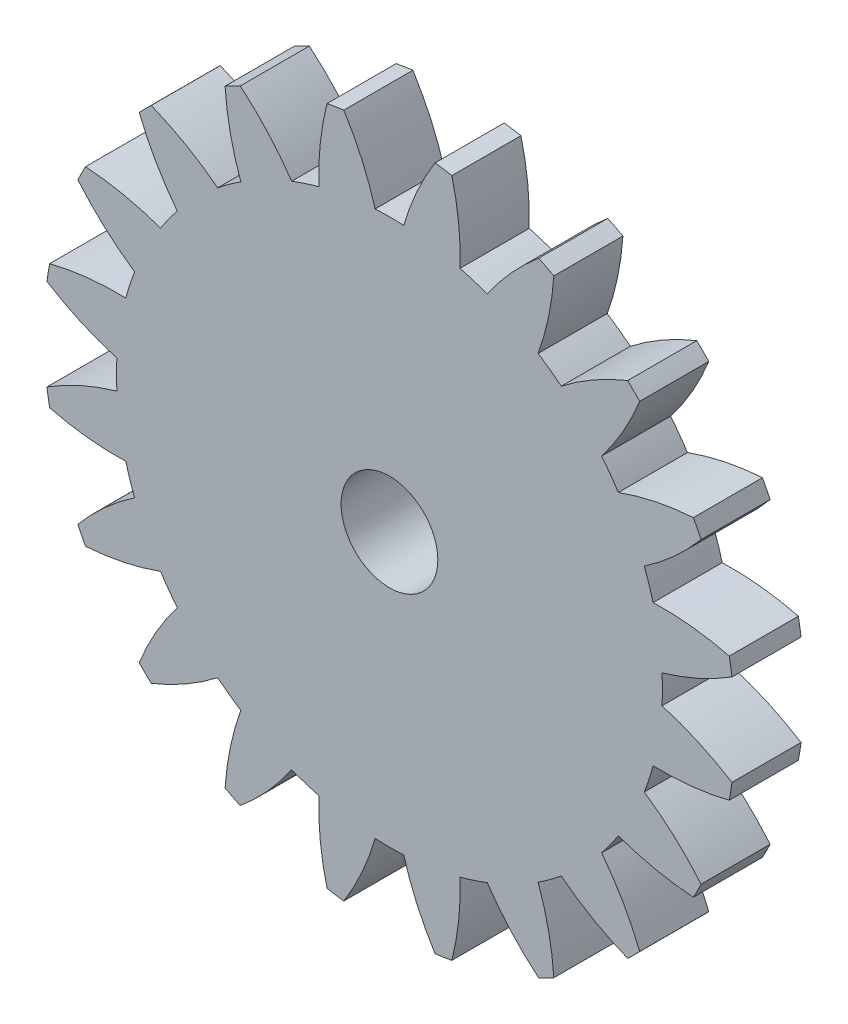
ISO-10303-21;
HEADER;
FILE_DESCRIPTION(('STEP AP214'),'2;1');
FILE_NAME('part.step','',(''),(''),'','','');
FILE_SCHEMA(('AUTOMOTIVE_DESIGN { 1 0 10303 214 1 1 1 1 }'));
ENDSEC;
DATA;
#1=APPLICATION_CONTEXT('core data for automotive mechanical design processes');
#2=APPLICATION_PROTOCOL_DEFINITION('international standard','automotive_design',2000,#1);
#3=PRODUCT_CONTEXT('',#1,'mechanical');
#4=PRODUCT('Part','Part','',(#3));
#5=PRODUCT_RELATED_PRODUCT_CATEGORY('part','',(#4));
#6=PRODUCT_DEFINITION_FORMATION('','',#4);
#7=PRODUCT_DEFINITION_CONTEXT('part definition',#1,'design');
#8=PRODUCT_DEFINITION('design','',#6,#7);
#9=PRODUCT_DEFINITION_SHAPE('','',#8);
#10=(LENGTH_UNIT() NAMED_UNIT(*) SI_UNIT(.MILLI.,.METRE.));
#11=(NAMED_UNIT(*) PLANE_ANGLE_UNIT() SI_UNIT($,.RADIAN.));
#12=(NAMED_UNIT(*) SI_UNIT($,.STERADIAN.) SOLID_ANGLE_UNIT());
#13=UNCERTAINTY_MEASURE_WITH_UNIT(LENGTH_MEASURE(1.E-05),#10,'distance_accuracy_value','');
#14=(GEOMETRIC_REPRESENTATION_CONTEXT(3) GLOBAL_UNCERTAINTY_ASSIGNED_CONTEXT((#13)) GLOBAL_UNIT_ASSIGNED_CONTEXT((#10,
#11,#12)) REPRESENTATION_CONTEXT('',''));
#15=CARTESIAN_POINT('',(0.,0.,0.));
#16=DIRECTION('',(0.,0.,1.));
#17=DIRECTION('',(1.,0.,0.));
#18=AXIS2_PLACEMENT_3D('',#15,#16,#17);
#19=CARTESIAN_POINT('',(0.,-15.5,10.));
#20=DIRECTION('',(0.,0.,-1.));
#21=DIRECTION('',(-1.,0.,0.));
#22=AXIS2_PLACEMENT_3D('',#19,#20,#21);
#23=CYLINDRICAL_SURFACE('',#22,39.5);
#24=CARTESIAN_POINT('',(0.,-15.5,0.));
#25=DIRECTION('',(0.,0.,1.));
#26=DIRECTION('',(1.,0.,0.));
#27=AXIS2_PLACEMENT_3D('',#24,#25,#26);
#28=CIRCLE('',#27,39.5);
#29=CARTESIAN_POINT('',(39.4458666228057,-17.5672702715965,0.));
#30=VERTEX_POINT('',#29);
#31=CARTESIAN_POINT('',(39.4458666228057,-13.4327297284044,0.));
#32=VERTEX_POINT('',#31);
#33=EDGE_CURVE('E582',#30,#32,#28,.T.);
#34=ORIENTED_EDGE('',*,*,#33,.T.);
#35=DIRECTION('',(0.,0.,-1.));
#36=VECTOR('',#35,1.);
#37=CARTESIAN_POINT('',(39.4458666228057,-13.4327297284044,10.));
#38=LINE('',#37,#36);
#39=CARTESIAN_POINT('',(39.4458666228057,-13.4327297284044,10.));
#40=VERTEX_POINT('',#39);
#41=EDGE_CURVE('E11',#40,#32,#38,.T.);
#42=ORIENTED_EDGE('',*,*,#41,.F.);
#43=CARTESIAN_POINT('',(0.,-15.5,10.));
#44=DIRECTION('',(0.,0.,1.));
#45=DIRECTION('',(1.,0.,0.));
#46=AXIS2_PLACEMENT_3D('',#43,#44,#45);
#47=CIRCLE('',#46,39.5);
#48=CARTESIAN_POINT('',(39.4458666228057,-17.5672702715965,10.));
#49=VERTEX_POINT('',#48);
#50=EDGE_CURVE('E314',#49,#40,#47,.T.);
#51=ORIENTED_EDGE('',*,*,#50,.F.);
#52=DIRECTION('',(0.,0.,-1.));
#53=VECTOR('',#52,1.);
#54=CARTESIAN_POINT('',(39.4458666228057,-17.5672702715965,10.));
#55=LINE('',#54,#53);
#56=EDGE_CURVE('E577',#49,#30,#55,.T.);
#57=ORIENTED_EDGE('',*,*,#56,.T.);
#58=EDGE_LOOP('',(#34,#42,#51,#57));
#59=FACE_BOUND('',#58,.T.);
#60=ADVANCED_FACE('F41',(#59),#23,.T.);
#61=CARTESIAN_POINT('',(28.3439005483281,24.8647588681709,10.));
#62=DIRECTION('',(0.,0.,-1.));
#63=DIRECTION('',(-1.,0.,0.));
#64=AXIS2_PLACEMENT_3D('',#61,#62,#63);
#65=CYLINDRICAL_SURFACE('',#64,39.8741932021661);
#66=CARTESIAN_POINT('',(28.3439005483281,24.8647588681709,0.));
#67=DIRECTION('',(0.,0.,1.));
#68=DIRECTION('',(1.,0.,0.));
#69=AXIS2_PLACEMENT_3D('',#66,#67,#68);
#70=CIRCLE('',#69,39.8741932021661);
#71=CARTESIAN_POINT('',(49.5618741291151,-8.89540820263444,0.));
#72=VERTEX_POINT('',#71);
#73=EDGE_CURVE('E586',#72,#32,#70,.F.);
#74=ORIENTED_EDGE('',*,*,#73,.F.);
#75=DIRECTION('',(0.,0.,-1.));
#76=VECTOR('',#75,1.);
#77=CARTESIAN_POINT('',(49.5618741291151,-8.89540820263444,10.));
#78=LINE('',#77,#76);
#79=CARTESIAN_POINT('',(49.5618741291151,-8.89540820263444,10.));
#80=VERTEX_POINT('',#79);
#81=EDGE_CURVE('E51',#80,#72,#78,.T.);
#82=ORIENTED_EDGE('',*,*,#81,.F.);
#83=CARTESIAN_POINT('',(28.3439005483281,24.8647588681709,10.));
#84=DIRECTION('',(0.,0.,1.));
#85=DIRECTION('',(1.,0.,0.));
#86=AXIS2_PLACEMENT_3D('',#83,#84,#85);
#87=CIRCLE('',#86,39.8741932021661);
#88=EDGE_CURVE('E1083',#80,#40,#87,.F.);
#89=ORIENTED_EDGE('',*,*,#88,.T.);
#90=ORIENTED_EDGE('',*,*,#41,.T.);
#91=EDGE_LOOP('',(#74,#82,#89,#90));
#92=FACE_BOUND('',#91,.T.);
#93=ADVANCED_FACE('F1082',(#92),#65,.T.);
#94=CARTESIAN_POINT('',(0.,-15.5,10.));
#95=DIRECTION('',(0.,0.,-1.));
#96=DIRECTION('',(-1.,0.,0.));
#97=AXIS2_PLACEMENT_3D('',#94,#95,#96);
#98=CYLINDRICAL_SURFACE('',#97,50.0000000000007);
#99=CARTESIAN_POINT('',(0.,-15.5,0.));
#100=DIRECTION('',(0.,0.,1.));
#101=DIRECTION('',(1.,0.,0.));
#102=AXIS2_PLACEMENT_3D('',#99,#100,#101);
#103=CIRCLE('',#102,50.0000000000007);
#104=CARTESIAN_POINT('',(49.1770744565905,-6.46587868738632,0.));
#105=VERTEX_POINT('',#104);
#106=EDGE_CURVE('E592',#72,#105,#103,.T.);
#107=ORIENTED_EDGE('',*,*,#106,.T.);
#108=DIRECTION('',(0.,0.,-1.));
#109=VECTOR('',#108,1.);
#110=CARTESIAN_POINT('',(49.1770744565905,-6.46587868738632,10.));
#111=LINE('',#110,#109);
#112=CARTESIAN_POINT('',(49.1770744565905,-6.46587868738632,10.));
#113=VERTEX_POINT('',#112);
#114=EDGE_CURVE('E1064',#113,#105,#111,.T.);
#115=ORIENTED_EDGE('',*,*,#114,.F.);
#116=CARTESIAN_POINT('',(0.,-15.5,10.));
#117=DIRECTION('',(0.,0.,1.));
#118=DIRECTION('',(1.,0.,0.));
#119=AXIS2_PLACEMENT_3D('',#116,#117,#118);
#120=CIRCLE('',#119,50.0000000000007);
#121=EDGE_CURVE('E1073',#80,#113,#120,.T.);
#122=ORIENTED_EDGE('',*,*,#121,.F.);
#123=ORIENTED_EDGE('',*,*,#81,.T.);
#124=EDGE_LOOP('',(#107,#115,#122,#123));
#125=FACE_BOUND('',#124,.T.);
#126=ADVANCED_FACE('F1071',(#125),#98,.T.);
#127=CARTESIAN_POINT('',(39.430047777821,-45.1304199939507,10.));
#128=DIRECTION('',(0.,0.,-1.));
#129=DIRECTION('',(-1.,0.,0.));
#130=AXIS2_PLACEMENT_3D('',#127,#128,#129);
#131=CYLINDRICAL_SURFACE('',#130,39.8741932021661);
#132=CARTESIAN_POINT('',(39.430047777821,-45.1304199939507,0.));
#133=DIRECTION('',(0.,0.,1.));
#134=DIRECTION('',(1.,0.,0.));
#135=AXIS2_PLACEMENT_3D('',#132,#133,#134);
#136=CIRCLE('',#135,39.8741932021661);
#137=CARTESIAN_POINT('',(38.1540701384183,-5.2766477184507,0.));
#138=VERTEX_POINT('',#137);
#139=EDGE_CURVE('E595',#105,#138,#136,.T.);
#140=ORIENTED_EDGE('',*,*,#139,.T.);
#141=DIRECTION('',(0.,0.,-1.));
#142=VECTOR('',#141,1.);
#143=CARTESIAN_POINT('',(38.1540701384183,-5.2766477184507,10.));
#144=LINE('',#143,#142);
#145=CARTESIAN_POINT('',(38.1540701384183,-5.2766477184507,10.));
#146=VERTEX_POINT('',#145);
#147=EDGE_CURVE('E1060',#146,#138,#144,.T.);
#148=ORIENTED_EDGE('',*,*,#147,.F.);
#149=CARTESIAN_POINT('',(39.430047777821,-45.1304199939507,10.));
#150=DIRECTION('',(0.,0.,1.));
#151=DIRECTION('',(1.,0.,0.));
#152=AXIS2_PLACEMENT_3D('',#149,#150,#151);
#153=CIRCLE('',#152,39.8741932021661);
#154=EDGE_CURVE('E1200',#113,#146,#153,.T.);
#155=ORIENTED_EDGE('',*,*,#154,.F.);
#156=ORIENTED_EDGE('',*,*,#114,.T.);
#157=EDGE_LOOP('',(#140,#148,#155,#156));
#158=FACE_BOUND('',#157,.T.);
#159=ADVANCED_FACE('F1628',(#158),#131,.T.);
#160=CARTESIAN_POINT('',(36.8764268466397,-1.34446599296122,0.));
#161=VERTEX_POINT('',#160);
#162=EDGE_CURVE('E588',#138,#161,#28,.T.);
#163=ORIENTED_EDGE('',*,*,#162,.T.);
#164=DIRECTION('',(0.,0.,-1.));
#165=VECTOR('',#164,1.);
#166=CARTESIAN_POINT('',(36.8764268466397,-1.34446599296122,10.));
#167=LINE('',#166,#165);
#168=CARTESIAN_POINT('',(36.8764268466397,-1.34446599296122,10.));
#169=VERTEX_POINT('',#168);
#170=EDGE_CURVE('E1057',#169,#161,#167,.T.);
#171=ORIENTED_EDGE('',*,*,#170,.F.);
#172=EDGE_CURVE('E1194',#146,#169,#47,.T.);
#173=ORIENTED_EDGE('',*,*,#172,.F.);
#174=ORIENTED_EDGE('',*,*,#147,.T.);
#175=EDGE_LOOP('',(#163,#171,#173,#174));
#176=FACE_BOUND('',#175,.T.);
#177=ADVANCED_FACE('F1180',(#176),#23,.T.);
#178=CARTESIAN_POINT('',(14.4832548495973,31.6479139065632,10.));
#179=DIRECTION('',(0.,0.,-1.));
#180=DIRECTION('',(-1.,0.,0.));
#181=AXIS2_PLACEMENT_3D('',#178,#179,#180);
#182=CYLINDRICAL_SURFACE('',#181,39.8741932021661);
#183=CARTESIAN_POINT('',(14.4832548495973,31.6479139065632,0.));
#184=DIRECTION('',(0.,0.,1.));
#185=DIRECTION('',(1.,0.,0.));
#186=AXIS2_PLACEMENT_3D('',#183,#184,#185);
#187=CIRCLE('',#186,39.8741932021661);
#188=CARTESIAN_POINT('',(45.0952122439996,6.09680144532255,0.));
#189=VERTEX_POINT('',#188);
#190=EDGE_CURVE('E598',#189,#161,#187,.F.);
#191=ORIENTED_EDGE('',*,*,#190,.F.);
#192=DIRECTION('',(0.,0.,-1.));
#193=VECTOR('',#192,1.);
#194=CARTESIAN_POINT('',(45.0952122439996,6.09680144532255,10.));
#195=LINE('',#194,#193);
#196=CARTESIAN_POINT('',(45.0952122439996,6.09680144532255,10.));
#197=VERTEX_POINT('',#196);
#198=EDGE_CURVE('E1054',#197,#189,#195,.T.);
#199=ORIENTED_EDGE('',*,*,#198,.F.);
#200=CARTESIAN_POINT('',(14.4832548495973,31.6479139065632,10.));
#201=DIRECTION('',(0.,0.,1.));
#202=DIRECTION('',(1.,0.,0.));
#203=AXIS2_PLACEMENT_3D('',#200,#201,#202);
#204=CIRCLE('',#203,39.8741932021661);
#205=EDGE_CURVE('E1191',#197,#169,#204,.F.);
#206=ORIENTED_EDGE('',*,*,#205,.T.);
#207=ORIENTED_EDGE('',*,*,#170,.T.);
#208=EDGE_LOOP('',(#191,#199,#206,#207));
#209=FACE_BOUND('',#208,.T.);
#210=ADVANCED_FACE('F1188',(#209),#182,.T.);
#211=CARTESIAN_POINT('',(0.,-15.5,10.));
#212=DIRECTION('',(0.,0.,-1.));
#213=DIRECTION('',(-1.,0.,0.));
#214=AXIS2_PLACEMENT_3D('',#211,#212,#213);
#215=CYLINDRICAL_SURFACE('',#214,50.0000000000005);
#216=CARTESIAN_POINT('',(0.,-15.5,0.));
#217=DIRECTION('',(0.,0.,1.));
#218=DIRECTION('',(1.,0.,0.));
#219=AXIS2_PLACEMENT_3D('',#216,#217,#218);
#220=CIRCLE('',#219,50.0000000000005);
#221=CARTESIAN_POINT('',(43.9784800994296,8.28851168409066,0.));
#222=VERTEX_POINT('',#221);
#223=EDGE_CURVE('E602',#189,#222,#220,.T.);
#224=ORIENTED_EDGE('',*,*,#223,.T.);
#225=DIRECTION('',(0.,0.,-1.));
#226=VECTOR('',#225,1.);
#227=CARTESIAN_POINT('',(43.9784800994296,8.28851168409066,10.));
#228=LINE('',#227,#226);
#229=CARTESIAN_POINT('',(43.9784800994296,8.28851168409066,10.));
#230=VERTEX_POINT('',#229);
#231=EDGE_CURVE('E1050',#230,#222,#228,.T.);
#232=ORIENTED_EDGE('',*,*,#231,.F.);
#233=CARTESIAN_POINT('',(0.,-15.5,10.));
#234=DIRECTION('',(0.,0.,1.));
#235=DIRECTION('',(1.,0.,0.));
#236=AXIS2_PLACEMENT_3D('',#233,#234,#235);
#237=CIRCLE('',#236,50.0000000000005);
#238=EDGE_CURVE('E1193',#197,#230,#237,.T.);
#239=ORIENTED_EDGE('',*,*,#238,.F.);
#240=ORIENTED_EDGE('',*,*,#198,.T.);
#241=EDGE_LOOP('',(#224,#232,#239,#240));
#242=FACE_BOUND('',#241,.T.);
#243=ADVANCED_FACE('F1624',(#242),#215,.T.);
#244=CARTESIAN_POINT('',(46.6565072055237,-31.4956491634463,10.));
#245=DIRECTION('',(0.,0.,-1.));
#246=DIRECTION('',(-1.,0.,0.));
#247=AXIS2_PLACEMENT_3D('',#244,#245,#246);
#248=CYLINDRICAL_SURFACE('',#247,39.8741932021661);
#249=CARTESIAN_POINT('',(46.6565072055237,-31.4956491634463,0.));
#250=DIRECTION('',(0.,0.,1.));
#251=DIRECTION('',(1.,0.,0.));
#252=AXIS2_PLACEMENT_3D('',#249,#250,#251);
#253=CIRCLE('',#252,39.8741932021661);
#254=CARTESIAN_POINT('',(33.1274874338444,6.0132418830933,0.));
#255=VERTEX_POINT('',#254);
#256=EDGE_CURVE('E605',#222,#255,#253,.T.);
#257=ORIENTED_EDGE('',*,*,#256,.T.);
#258=DIRECTION('',(0.,0.,-1.));
#259=VECTOR('',#258,1.);
#260=CARTESIAN_POINT('',(33.1274874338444,6.0132418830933,10.));
#261=LINE('',#260,#259);
#262=CARTESIAN_POINT('',(33.1274874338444,6.0132418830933,10.));
#263=VERTEX_POINT('',#262);
#264=EDGE_CURVE('E1046',#263,#255,#261,.T.);
#265=ORIENTED_EDGE('',*,*,#264,.F.);
#266=CARTESIAN_POINT('',(46.6565072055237,-31.4956491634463,10.));
#267=DIRECTION('',(0.,0.,1.));
#268=DIRECTION('',(1.,0.,0.));
#269=AXIS2_PLACEMENT_3D('',#266,#267,#268);
#270=CIRCLE('',#269,39.8741932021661);
#271=EDGE_CURVE('E1198',#230,#263,#270,.T.);
#272=ORIENTED_EDGE('',*,*,#271,.F.);
#273=ORIENTED_EDGE('',*,*,#231,.T.);
#274=EDGE_LOOP('',(#257,#265,#272,#273));
#275=FACE_BOUND('',#274,.T.);
#276=ADVANCED_FACE('F1617',(#275),#248,.T.);
#277=CARTESIAN_POINT('',(30.6972654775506,9.35815544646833,0.));
#278=VERTEX_POINT('',#277);
#279=EDGE_CURVE('E608',#255,#278,#28,.T.);
#280=ORIENTED_EDGE('',*,*,#279,.T.);
#281=DIRECTION('',(0.,0.,-1.));
#282=VECTOR('',#281,1.);
#283=CARTESIAN_POINT('',(30.6972654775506,9.35815544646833,10.));
#284=LINE('',#283,#282);
#285=CARTESIAN_POINT('',(30.6972654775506,9.35815544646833,10.));
#286=VERTEX_POINT('',#285);
#287=EDGE_CURVE('E1043',#286,#278,#284,.T.);
#288=ORIENTED_EDGE('',*,*,#287,.F.);
#289=EDGE_CURVE('E1201',#263,#286,#47,.T.);
#290=ORIENTED_EDGE('',*,*,#289,.F.);
#291=ORIENTED_EDGE('',*,*,#264,.T.);
#292=EDGE_LOOP('',(#280,#288,#290,#291));
#293=FACE_BOUND('',#292,.T.);
#294=ADVANCED_FACE('F1605',(#293),#23,.T.);
#295=CARTESIAN_POINT('',(-0.795112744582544,33.8159026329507,10.));
#296=DIRECTION('',(0.,0.,-1.));
#297=DIRECTION('',(-1.,0.,0.));
#298=AXIS2_PLACEMENT_3D('',#295,#296,#297);
#299=CYLINDRICAL_SURFACE('',#298,39.8741932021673);
#300=CARTESIAN_POINT('',(-0.795112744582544,33.8159026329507,0.));
#301=DIRECTION('',(0.,0.,1.));
#302=DIRECTION('',(1.,0.,0.));
#303=AXIS2_PLACEMENT_3D('',#300,#301,#302);
#304=CIRCLE('',#303,39.8741932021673);
#305=CARTESIAN_POINT('',(36.2143167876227,18.9749656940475,0.));
#306=VERTEX_POINT('',#305);
#307=EDGE_CURVE('E609',#306,#278,#304,.F.);
#308=ORIENTED_EDGE('',*,*,#307,.F.);
#309=DIRECTION('',(0.,0.,-1.));
#310=VECTOR('',#309,1.);
#311=CARTESIAN_POINT('',(36.2143167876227,18.9749656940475,10.));
#312=LINE('',#311,#310);
#313=CARTESIAN_POINT('',(36.2143167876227,18.9749656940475,10.));
#314=VERTEX_POINT('',#313);
#315=EDGE_CURVE('E1040',#314,#306,#312,.T.);
#316=ORIENTED_EDGE('',*,*,#315,.F.);
#317=CARTESIAN_POINT('',(-0.795112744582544,33.8159026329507,10.));
#318=DIRECTION('',(0.,0.,1.));
#319=DIRECTION('',(1.,0.,0.));
#320=AXIS2_PLACEMENT_3D('',#317,#318,#319);
#321=CIRCLE('',#320,39.8741932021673);
#322=EDGE_CURVE('E1207',#314,#286,#321,.F.);
#323=ORIENTED_EDGE('',*,*,#322,.T.);
#324=ORIENTED_EDGE('',*,*,#287,.T.);
#325=EDGE_LOOP('',(#308,#316,#323,#324));
#326=FACE_BOUND('',#325,.T.);
#327=ADVANCED_FACE('F1616',(#326),#299,.T.);
#328=CARTESIAN_POINT('',(0.,-15.5,10.));
#329=DIRECTION('',(0.,0.,-1.));
#330=DIRECTION('',(-1.,0.,0.));
#331=AXIS2_PLACEMENT_3D('',#328,#329,#330);
#332=CYLINDRICAL_SURFACE('',#331,50.0000000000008);
#333=CARTESIAN_POINT('',(0.,-15.5,0.));
#334=DIRECTION('',(0.,0.,1.));
#335=DIRECTION('',(1.,0.,0.));
#336=AXIS2_PLACEMENT_3D('',#333,#334,#335);
#337=CIRCLE('',#336,50.0000000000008);
#338=CARTESIAN_POINT('',(34.4749656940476,20.7143167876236,0.));
#339=VERTEX_POINT('',#338);
#340=EDGE_CURVE('E613',#306,#339,#337,.T.);
#341=ORIENTED_EDGE('',*,*,#340,.T.);
#342=DIRECTION('',(0.,0.,-1.));
#343=VECTOR('',#342,1.);
#344=CARTESIAN_POINT('',(34.4749656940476,20.7143167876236,10.));
#345=LINE('',#344,#343);
#346=CARTESIAN_POINT('',(34.4749656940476,20.7143167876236,10.));
#347=VERTEX_POINT('',#346);
#348=EDGE_CURVE('E1036',#347,#339,#345,.T.);
#349=ORIENTED_EDGE('',*,*,#348,.F.);
#350=CARTESIAN_POINT('',(0.,-15.5,10.));
#351=DIRECTION('',(0.,0.,1.));
#352=DIRECTION('',(1.,0.,0.));
#353=AXIS2_PLACEMENT_3D('',#350,#351,#352);
#354=CIRCLE('',#353,50.0000000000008);
#355=EDGE_CURVE('E1211',#314,#347,#354,.T.);
#356=ORIENTED_EDGE('',*,*,#355,.F.);
#357=ORIENTED_EDGE('',*,*,#315,.T.);
#358=EDGE_LOOP('',(#341,#349,#356,#357));
#359=FACE_BOUND('',#358,.T.);
#360=ADVANCED_FACE('F1612',(#359),#332,.T.);
#361=CARTESIAN_POINT('',(49.3159026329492,-16.2951127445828,10.));
#362=DIRECTION('',(0.,0.,-1.));
#363=DIRECTION('',(-1.,0.,0.));
#364=AXIS2_PLACEMENT_3D('',#361,#362,#363);
#365=CYLINDRICAL_SURFACE('',#364,39.8741932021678);
#366=CARTESIAN_POINT('',(49.3159026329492,-16.2951127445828,0.));
#367=DIRECTION('',(0.,0.,1.));
#368=DIRECTION('',(1.,0.,0.));
#369=AXIS2_PLACEMENT_3D('',#366,#367,#368);
#370=CIRCLE('',#369,39.8741932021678);
#371=CARTESIAN_POINT('',(24.8581554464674,15.1972654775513,0.));
#372=VERTEX_POINT('',#371);
#373=EDGE_CURVE('E616',#339,#372,#370,.T.);
#374=ORIENTED_EDGE('',*,*,#373,.T.);
#375=DIRECTION('',(0.,0.,-1.));
#376=VECTOR('',#375,1.);
#377=CARTESIAN_POINT('',(24.8581554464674,15.1972654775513,10.));
#378=LINE('',#377,#376);
#379=CARTESIAN_POINT('',(24.8581554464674,15.1972654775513,10.));
#380=VERTEX_POINT('',#379);
#381=EDGE_CURVE('E1032',#380,#372,#378,.T.);
#382=ORIENTED_EDGE('',*,*,#381,.F.);
#383=CARTESIAN_POINT('',(49.3159026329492,-16.2951127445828,10.));
#384=DIRECTION('',(0.,0.,1.));
#385=DIRECTION('',(1.,0.,0.));
#386=AXIS2_PLACEMENT_3D('',#383,#384,#385);
#387=CIRCLE('',#386,39.8741932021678);
#388=EDGE_CURVE('E1214',#347,#380,#387,.T.);
#389=ORIENTED_EDGE('',*,*,#388,.F.);
#390=ORIENTED_EDGE('',*,*,#348,.T.);
#391=EDGE_LOOP('',(#374,#382,#389,#390));
#392=FACE_BOUND('',#391,.T.);
#393=ADVANCED_FACE('F1604',(#392),#365,.T.);
#394=CARTESIAN_POINT('',(21.513241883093,17.6274874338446,0.));
#395=VERTEX_POINT('',#394);
#396=EDGE_CURVE('E619',#372,#395,#28,.T.);
#397=ORIENTED_EDGE('',*,*,#396,.T.);
#398=DIRECTION('',(0.,0.,-1.));
#399=VECTOR('',#398,1.);
#400=CARTESIAN_POINT('',(21.513241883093,17.6274874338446,10.));
#401=LINE('',#400,#399);
#402=CARTESIAN_POINT('',(21.513241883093,17.6274874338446,10.));
#403=VERTEX_POINT('',#402);
#404=EDGE_CURVE('E1029',#403,#395,#401,.T.);
#405=ORIENTED_EDGE('',*,*,#404,.F.);
#406=EDGE_CURVE('E1217',#380,#403,#47,.T.);
#407=ORIENTED_EDGE('',*,*,#406,.F.);
#408=ORIENTED_EDGE('',*,*,#381,.T.);
#409=EDGE_LOOP('',(#397,#405,#407,#408));
#410=FACE_BOUND('',#409,.T.);
#411=ADVANCED_FACE('F1592',(#410),#23,.T.);
#412=CARTESIAN_POINT('',(-15.9956491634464,31.1565072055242,10.));
#413=DIRECTION('',(0.,0.,-1.));
#414=DIRECTION('',(-1.,0.,0.));
#415=AXIS2_PLACEMENT_3D('',#412,#413,#414);
#416=CYLINDRICAL_SURFACE('',#415,39.8741932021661);
#417=CARTESIAN_POINT('',(-15.9956491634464,31.1565072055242,0.));
#418=DIRECTION('',(0.,0.,1.));
#419=DIRECTION('',(1.,0.,0.));
#420=AXIS2_PLACEMENT_3D('',#417,#418,#419);
#421=CIRCLE('',#420,39.8741932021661);
#422=CARTESIAN_POINT('',(23.7885116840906,28.4784800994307,0.));
#423=VERTEX_POINT('',#422);
#424=EDGE_CURVE('E620',#423,#395,#421,.F.);
#425=ORIENTED_EDGE('',*,*,#424,.F.);
#426=DIRECTION('',(0.,0.,-1.));
#427=VECTOR('',#426,1.);
#428=CARTESIAN_POINT('',(23.7885116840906,28.4784800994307,10.));
#429=LINE('',#428,#427);
#430=CARTESIAN_POINT('',(23.7885116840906,28.4784800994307,10.));
#431=VERTEX_POINT('',#430);
#432=EDGE_CURVE('E1026',#431,#423,#429,.T.);
#433=ORIENTED_EDGE('',*,*,#432,.F.);
#434=CARTESIAN_POINT('',(-15.9956491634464,31.1565072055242,10.));
#435=DIRECTION('',(0.,0.,1.));
#436=DIRECTION('',(1.,0.,0.));
#437=AXIS2_PLACEMENT_3D('',#434,#435,#436);
#438=CIRCLE('',#437,39.8741932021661);
#439=EDGE_CURVE('E1218',#431,#403,#438,.F.);
#440=ORIENTED_EDGE('',*,*,#439,.T.);
#441=ORIENTED_EDGE('',*,*,#404,.T.);
#442=EDGE_LOOP('',(#425,#433,#440,#441));
#443=FACE_BOUND('',#442,.T.);
#444=ADVANCED_FACE('F1603',(#443),#416,.T.);
#445=CARTESIAN_POINT('',(0.,-15.5,10.));
#446=DIRECTION('',(0.,0.,-1.));
#447=DIRECTION('',(-1.,0.,0.));
#448=AXIS2_PLACEMENT_3D('',#445,#446,#447);
#449=CYLINDRICAL_SURFACE('',#448,50.000000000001);
#450=CARTESIAN_POINT('',(0.,-15.5,0.));
#451=DIRECTION('',(0.,0.,1.));
#452=DIRECTION('',(1.,0.,0.));
#453=AXIS2_PLACEMENT_3D('',#450,#451,#452);
#454=CIRCLE('',#453,50.000000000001);
#455=CARTESIAN_POINT('',(21.5968014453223,29.5952122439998,0.));
#456=VERTEX_POINT('',#455);
#457=EDGE_CURVE('E624',#423,#456,#454,.T.);
#458=ORIENTED_EDGE('',*,*,#457,.T.);
#459=DIRECTION('',(0.,0.,-1.));
#460=VECTOR('',#459,1.);
#461=CARTESIAN_POINT('',(21.5968014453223,29.5952122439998,10.));
#462=LINE('',#461,#460);
#463=CARTESIAN_POINT('',(21.5968014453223,29.5952122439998,10.));
#464=VERTEX_POINT('',#463);
#465=EDGE_CURVE('E1022',#464,#456,#462,.T.);
#466=ORIENTED_EDGE('',*,*,#465,.F.);
#467=CARTESIAN_POINT('',(0.,-15.5,10.));
#468=DIRECTION('',(0.,0.,1.));
#469=DIRECTION('',(1.,0.,0.));
#470=AXIS2_PLACEMENT_3D('',#467,#468,#469);
#471=CIRCLE('',#470,50.000000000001);
#472=EDGE_CURVE('E1222',#431,#464,#471,.T.);
#473=ORIENTED_EDGE('',*,*,#472,.F.);
#474=ORIENTED_EDGE('',*,*,#432,.T.);
#475=EDGE_LOOP('',(#458,#466,#473,#474));
#476=FACE_BOUND('',#475,.T.);
#477=ADVANCED_FACE('F1599',(#476),#449,.T.);
#478=CARTESIAN_POINT('',(47.1479139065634,-1.01674515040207,10.));
#479=DIRECTION('',(0.,0.,-1.));
#480=DIRECTION('',(-1.,0.,0.));
#481=AXIS2_PLACEMENT_3D('',#478,#479,#480);
#482=CYLINDRICAL_SURFACE('',#481,39.8741932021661);
#483=CARTESIAN_POINT('',(47.1479139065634,-1.01674515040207,0.));
#484=DIRECTION('',(0.,0.,1.));
#485=DIRECTION('',(1.,0.,0.));
#486=AXIS2_PLACEMENT_3D('',#483,#484,#485);
#487=CIRCLE('',#486,39.8741932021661);
#488=CARTESIAN_POINT('',(14.1555340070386,21.3764268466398,0.));
#489=VERTEX_POINT('',#488);
#490=EDGE_CURVE('E627',#456,#489,#487,.T.);
#491=ORIENTED_EDGE('',*,*,#490,.T.);
#492=DIRECTION('',(0.,0.,-1.));
#493=VECTOR('',#492,1.);
#494=CARTESIAN_POINT('',(14.1555340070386,21.3764268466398,10.));
#495=LINE('',#494,#493);
#496=CARTESIAN_POINT('',(14.1555340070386,21.3764268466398,10.));
#497=VERTEX_POINT('',#496);
#498=EDGE_CURVE('E1018',#497,#489,#495,.T.);
#499=ORIENTED_EDGE('',*,*,#498,.F.);
#500=CARTESIAN_POINT('',(47.1479139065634,-1.01674515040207,10.));
#501=DIRECTION('',(0.,0.,1.));
#502=DIRECTION('',(1.,0.,0.));
#503=AXIS2_PLACEMENT_3D('',#500,#501,#502);
#504=CIRCLE('',#503,39.8741932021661);
#505=EDGE_CURVE('E1225',#464,#497,#504,.T.);
#506=ORIENTED_EDGE('',*,*,#505,.F.);
#507=ORIENTED_EDGE('',*,*,#465,.T.);
#508=EDGE_LOOP('',(#491,#499,#506,#507));
#509=FACE_BOUND('',#508,.T.);
#510=ADVANCED_FACE('F1591',(#509),#482,.T.);
#511=CARTESIAN_POINT('',(10.2233522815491,22.6540701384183,0.));
#512=VERTEX_POINT('',#511);
#513=EDGE_CURVE('E630',#489,#512,#28,.T.);
#514=ORIENTED_EDGE('',*,*,#513,.T.);
#515=DIRECTION('',(0.,0.,-1.));
#516=VECTOR('',#515,1.);
#517=CARTESIAN_POINT('',(10.2233522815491,22.6540701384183,10.));
#518=LINE('',#517,#516);
#519=CARTESIAN_POINT('',(10.2233522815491,22.6540701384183,10.));
#520=VERTEX_POINT('',#519);
#521=EDGE_CURVE('E1015',#520,#512,#518,.T.);
#522=ORIENTED_EDGE('',*,*,#521,.F.);
#523=EDGE_CURVE('E1228',#497,#520,#47,.T.);
#524=ORIENTED_EDGE('',*,*,#523,.F.);
#525=ORIENTED_EDGE('',*,*,#498,.T.);
#526=EDGE_LOOP('',(#514,#522,#524,#525));
#527=FACE_BOUND('',#526,.T.);
#528=ADVANCED_FACE('F1579',(#527),#23,.T.);
#529=CARTESIAN_POINT('',(-29.6304199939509,23.9300477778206,10.));
#530=DIRECTION('',(0.,0.,-1.));
#531=DIRECTION('',(-1.,0.,0.));
#532=AXIS2_PLACEMENT_3D('',#529,#530,#531);
#533=CYLINDRICAL_SURFACE('',#532,39.8741932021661);
#534=CARTESIAN_POINT('',(-29.6304199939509,23.9300477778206,0.));
#535=DIRECTION('',(0.,0.,1.));
#536=DIRECTION('',(1.,0.,0.));
#537=AXIS2_PLACEMENT_3D('',#534,#535,#536);
#538=CIRCLE('',#537,39.8741932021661);
#539=CARTESIAN_POINT('',(9.03412131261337,33.6770744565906,0.));
#540=VERTEX_POINT('',#539);
#541=EDGE_CURVE('E631',#540,#512,#538,.F.);
#542=ORIENTED_EDGE('',*,*,#541,.F.);
#543=DIRECTION('',(0.,0.,-1.));
#544=VECTOR('',#543,1.);
#545=CARTESIAN_POINT('',(9.03412131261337,33.6770744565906,10.));
#546=LINE('',#545,#544);
#547=CARTESIAN_POINT('',(9.03412131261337,33.6770744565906,10.));
#548=VERTEX_POINT('',#547);
#549=EDGE_CURVE('E1012',#548,#540,#546,.T.);
#550=ORIENTED_EDGE('',*,*,#549,.F.);
#551=CARTESIAN_POINT('',(-29.6304199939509,23.9300477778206,10.));
#552=DIRECTION('',(0.,0.,1.));
#553=DIRECTION('',(1.,0.,0.));
#554=AXIS2_PLACEMENT_3D('',#551,#552,#553);
#555=CIRCLE('',#554,39.8741932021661);
#556=EDGE_CURVE('E1229',#548,#520,#555,.F.);
#557=ORIENTED_EDGE('',*,*,#556,.T.);
#558=ORIENTED_EDGE('',*,*,#521,.T.);
#559=EDGE_LOOP('',(#542,#550,#557,#558));
#560=FACE_BOUND('',#559,.T.);
#561=ADVANCED_FACE('F1590',(#560),#533,.T.);
#562=CARTESIAN_POINT('',(0.,-15.5,10.));
#563=DIRECTION('',(0.,0.,-1.));
#564=DIRECTION('',(-1.,0.,0.));
#565=AXIS2_PLACEMENT_3D('',#562,#563,#564);
#566=CYLINDRICAL_SURFACE('',#565,50.0000000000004);
#567=CARTESIAN_POINT('',(0.,-15.5,0.));
#568=DIRECTION('',(0.,0.,1.));
#569=DIRECTION('',(1.,0.,0.));
#570=AXIS2_PLACEMENT_3D('',#567,#568,#569);
#571=CIRCLE('',#570,50.0000000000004);
#572=CARTESIAN_POINT('',(6.60459179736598,34.0618741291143,0.));
#573=VERTEX_POINT('',#572);
#574=EDGE_CURVE('E635',#540,#573,#571,.T.);
#575=ORIENTED_EDGE('',*,*,#574,.T.);
#576=DIRECTION('',(0.,0.,-1.));
#577=VECTOR('',#576,1.);
#578=CARTESIAN_POINT('',(6.60459179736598,34.0618741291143,10.));
#579=LINE('',#578,#577);
#580=CARTESIAN_POINT('',(6.60459179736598,34.0618741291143,10.));
#581=VERTEX_POINT('',#580);
#582=EDGE_CURVE('E1008',#581,#573,#579,.T.);
#583=ORIENTED_EDGE('',*,*,#582,.F.);
#584=CARTESIAN_POINT('',(0.,-15.5,10.));
#585=DIRECTION('',(0.,0.,1.));
#586=DIRECTION('',(1.,0.,0.));
#587=AXIS2_PLACEMENT_3D('',#584,#585,#586);
#588=CIRCLE('',#587,50.0000000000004);
#589=EDGE_CURVE('E1233',#548,#581,#588,.T.);
#590=ORIENTED_EDGE('',*,*,#589,.F.);
#591=ORIENTED_EDGE('',*,*,#549,.T.);
#592=EDGE_LOOP('',(#575,#583,#590,#591));
#593=FACE_BOUND('',#592,.T.);
#594=ADVANCED_FACE('F1586',(#593),#566,.T.);
#595=CARTESIAN_POINT('',(40.3647588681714,12.8439005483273,10.));
#596=DIRECTION('',(0.,0.,-1.));
#597=DIRECTION('',(-1.,0.,0.));
#598=AXIS2_PLACEMENT_3D('',#595,#596,#597);
#599=CYLINDRICAL_SURFACE('',#598,39.8741932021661);
#600=CARTESIAN_POINT('',(40.3647588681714,12.8439005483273,0.));
#601=DIRECTION('',(0.,0.,1.));
#602=DIRECTION('',(1.,0.,0.));
#603=AXIS2_PLACEMENT_3D('',#600,#601,#602);
#604=CIRCLE('',#603,39.8741932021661);
#605=CARTESIAN_POINT('',(2.06727027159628,23.9458666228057,0.));
#606=VERTEX_POINT('',#605);
#607=EDGE_CURVE('E638',#573,#606,#604,.T.);
#608=ORIENTED_EDGE('',*,*,#607,.T.);
#609=DIRECTION('',(0.,0.,-1.));
#610=VECTOR('',#609,1.);
#611=CARTESIAN_POINT('',(2.06727027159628,23.9458666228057,10.));
#612=LINE('',#611,#610);
#613=CARTESIAN_POINT('',(2.06727027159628,23.9458666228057,10.));
#614=VERTEX_POINT('',#613);
#615=EDGE_CURVE('E1004',#614,#606,#612,.T.);
#616=ORIENTED_EDGE('',*,*,#615,.F.);
#617=CARTESIAN_POINT('',(40.3647588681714,12.8439005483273,10.));
#618=DIRECTION('',(0.,0.,1.));
#619=DIRECTION('',(1.,0.,0.));
#620=AXIS2_PLACEMENT_3D('',#617,#618,#619);
#621=CIRCLE('',#620,39.8741932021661);
#622=EDGE_CURVE('E1236',#581,#614,#621,.T.);
#623=ORIENTED_EDGE('',*,*,#622,.F.);
#624=ORIENTED_EDGE('',*,*,#582,.T.);
#625=EDGE_LOOP('',(#608,#616,#623,#624));
#626=FACE_BOUND('',#625,.T.);
#627=ADVANCED_FACE('F1578',(#626),#599,.T.);
#628=CARTESIAN_POINT('',(-2.06727027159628,23.9458666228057,0.));
#629=VERTEX_POINT('',#628);
#630=EDGE_CURVE('E641',#606,#629,#28,.T.);
#631=ORIENTED_EDGE('',*,*,#630,.T.);
#632=DIRECTION('',(0.,0.,-1.));
#633=VECTOR('',#632,1.);
#634=CARTESIAN_POINT('',(-2.06727027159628,23.9458666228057,10.));
#635=LINE('',#634,#633);
#636=CARTESIAN_POINT('',(-2.06727027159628,23.9458666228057,10.));
#637=VERTEX_POINT('',#636);
#638=EDGE_CURVE('E1001',#637,#629,#635,.T.);
#639=ORIENTED_EDGE('',*,*,#638,.F.);
#640=EDGE_CURVE('E1239',#614,#637,#47,.T.);
#641=ORIENTED_EDGE('',*,*,#640,.F.);
#642=ORIENTED_EDGE('',*,*,#615,.T.);
#643=EDGE_LOOP('',(#631,#639,#641,#642));
#644=FACE_BOUND('',#643,.T.);
#645=ADVANCED_FACE('F1566',(#644),#23,.T.);
#646=CARTESIAN_POINT('',(-40.3647588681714,12.8439005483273,10.));
#647=DIRECTION('',(0.,0.,-1.));
#648=DIRECTION('',(-1.,0.,0.));
#649=AXIS2_PLACEMENT_3D('',#646,#647,#648);
#650=CYLINDRICAL_SURFACE('',#649,39.8741932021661);
#651=CARTESIAN_POINT('',(-40.3647588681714,12.8439005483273,0.));
#652=DIRECTION('',(0.,0.,1.));
#653=DIRECTION('',(1.,0.,0.));
#654=AXIS2_PLACEMENT_3D('',#651,#652,#653);
#655=CIRCLE('',#654,39.8741932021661);
#656=CARTESIAN_POINT('',(-6.60459179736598,34.0618741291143,0.));
#657=VERTEX_POINT('',#656);
#658=EDGE_CURVE('E642',#657,#629,#655,.F.);
#659=ORIENTED_EDGE('',*,*,#658,.F.);
#660=DIRECTION('',(0.,0.,-1.));
#661=VECTOR('',#660,1.);
#662=CARTESIAN_POINT('',(-6.60459179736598,34.0618741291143,10.));
#663=LINE('',#662,#661);
#664=CARTESIAN_POINT('',(-6.60459179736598,34.0618741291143,10.));
#665=VERTEX_POINT('',#664);
#666=EDGE_CURVE('E998',#665,#657,#663,.T.);
#667=ORIENTED_EDGE('',*,*,#666,.F.);
#668=CARTESIAN_POINT('',(-40.3647588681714,12.8439005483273,10.));
#669=DIRECTION('',(0.,0.,1.));
#670=DIRECTION('',(1.,0.,0.));
#671=AXIS2_PLACEMENT_3D('',#668,#669,#670);
#672=CIRCLE('',#671,39.8741932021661);
#673=EDGE_CURVE('E1240',#665,#637,#672,.F.);
#674=ORIENTED_EDGE('',*,*,#673,.T.);
#675=ORIENTED_EDGE('',*,*,#638,.T.);
#676=EDGE_LOOP('',(#659,#667,#674,#675));
#677=FACE_BOUND('',#676,.T.);
#678=ADVANCED_FACE('F1577',(#677),#650,.T.);
#679=CARTESIAN_POINT('',(0.,-15.5,10.));
#680=DIRECTION('',(0.,0.,-1.));
#681=DIRECTION('',(-1.,0.,0.));
#682=AXIS2_PLACEMENT_3D('',#679,#680,#681);
#683=CYLINDRICAL_SURFACE('',#682,49.9999999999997);
#684=CARTESIAN_POINT('',(0.,-15.5,0.));
#685=DIRECTION('',(0.,0.,1.));
#686=DIRECTION('',(1.,0.,0.));
#687=AXIS2_PLACEMENT_3D('',#684,#685,#686);
#688=CIRCLE('',#687,49.9999999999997);
#689=CARTESIAN_POINT('',(-9.03412131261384,33.6770744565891,0.));
#690=VERTEX_POINT('',#689);
#691=EDGE_CURVE('E646',#657,#690,#688,.T.);
#692=ORIENTED_EDGE('',*,*,#691,.T.);
#693=DIRECTION('',(0.,0.,-1.));
#694=VECTOR('',#693,1.);
#695=CARTESIAN_POINT('',(-9.03412131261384,33.6770744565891,10.));
#696=LINE('',#695,#694);
#697=CARTESIAN_POINT('',(-9.03412131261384,33.6770744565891,10.));
#698=VERTEX_POINT('',#697);
#699=EDGE_CURVE('E994',#698,#690,#696,.T.);
#700=ORIENTED_EDGE('',*,*,#699,.F.);
#701=CARTESIAN_POINT('',(0.,-15.5,10.));
#702=DIRECTION('',(0.,0.,1.));
#703=DIRECTION('',(1.,0.,0.));
#704=AXIS2_PLACEMENT_3D('',#701,#702,#703);
#705=CIRCLE('',#704,49.9999999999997);
#706=EDGE_CURVE('E1244',#665,#698,#705,.T.);
#707=ORIENTED_EDGE('',*,*,#706,.F.);
#708=ORIENTED_EDGE('',*,*,#666,.T.);
#709=EDGE_LOOP('',(#692,#700,#707,#708));
#710=FACE_BOUND('',#709,.T.);
#711=ADVANCED_FACE('F1573',(#710),#683,.T.);
#712=CARTESIAN_POINT('',(29.6304199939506,23.9300477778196,10.));
#713=DIRECTION('',(0.,0.,-1.));
#714=DIRECTION('',(-1.,0.,0.));
#715=AXIS2_PLACEMENT_3D('',#712,#713,#714);
#716=CYLINDRICAL_SURFACE('',#715,39.8741932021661);
#717=CARTESIAN_POINT('',(29.6304199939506,23.9300477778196,0.));
#718=DIRECTION('',(0.,0.,1.));
#719=DIRECTION('',(1.,0.,0.));
#720=AXIS2_PLACEMENT_3D('',#717,#718,#719);
#721=CIRCLE('',#720,39.8741932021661);
#722=CARTESIAN_POINT('',(-10.2233522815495,22.6540701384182,0.));
#723=VERTEX_POINT('',#722);
#724=EDGE_CURVE('E649',#690,#723,#721,.T.);
#725=ORIENTED_EDGE('',*,*,#724,.T.);
#726=DIRECTION('',(0.,0.,-1.));
#727=VECTOR('',#726,1.);
#728=CARTESIAN_POINT('',(-10.2233522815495,22.6540701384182,10.));
#729=LINE('',#728,#727);
#730=CARTESIAN_POINT('',(-10.2233522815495,22.6540701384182,10.));
#731=VERTEX_POINT('',#730);
#732=EDGE_CURVE('E990',#731,#723,#729,.T.);
#733=ORIENTED_EDGE('',*,*,#732,.F.);
#734=CARTESIAN_POINT('',(29.6304199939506,23.9300477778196,10.));
#735=DIRECTION('',(0.,0.,1.));
#736=DIRECTION('',(1.,0.,0.));
#737=AXIS2_PLACEMENT_3D('',#734,#735,#736);
#738=CIRCLE('',#737,39.8741932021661);
#739=EDGE_CURVE('E1247',#698,#731,#738,.T.);
#740=ORIENTED_EDGE('',*,*,#739,.F.);
#741=ORIENTED_EDGE('',*,*,#699,.T.);
#742=EDGE_LOOP('',(#725,#733,#740,#741));
#743=FACE_BOUND('',#742,.T.);
#744=ADVANCED_FACE('F1565',(#743),#716,.T.);
#745=CARTESIAN_POINT('',(-14.1555340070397,21.3764268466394,0.));
#746=VERTEX_POINT('',#745);
#747=EDGE_CURVE('E652',#723,#746,#28,.T.);
#748=ORIENTED_EDGE('',*,*,#747,.T.);
#749=DIRECTION('',(0.,0.,-1.));
#750=VECTOR('',#749,1.);
#751=CARTESIAN_POINT('',(-14.1555340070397,21.3764268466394,10.));
#752=LINE('',#751,#750);
#753=CARTESIAN_POINT('',(-14.1555340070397,21.3764268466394,10.));
#754=VERTEX_POINT('',#753);
#755=EDGE_CURVE('E987',#754,#746,#752,.T.);
#756=ORIENTED_EDGE('',*,*,#755,.F.);
#757=EDGE_CURVE('E1250',#731,#754,#47,.T.);
#758=ORIENTED_EDGE('',*,*,#757,.F.);
#759=ORIENTED_EDGE('',*,*,#732,.T.);
#760=EDGE_LOOP('',(#748,#756,#758,#759));
#761=FACE_BOUND('',#760,.T.);
#762=ADVANCED_FACE('F1553',(#761),#23,.T.);
#763=CARTESIAN_POINT('',(-47.1479139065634,-1.01674515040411,10.));
#764=DIRECTION('',(0.,0.,-1.));
#765=DIRECTION('',(-1.,0.,0.));
#766=AXIS2_PLACEMENT_3D('',#763,#764,#765);
#767=CYLINDRICAL_SURFACE('',#766,39.8741932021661);
#768=CARTESIAN_POINT('',(-47.1479139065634,-1.01674515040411,0.));
#769=DIRECTION('',(0.,0.,1.));
#770=DIRECTION('',(1.,0.,0.));
#771=AXIS2_PLACEMENT_3D('',#768,#769,#770);
#772=CIRCLE('',#771,39.8741932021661);
#773=CARTESIAN_POINT('',(-21.5968014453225,29.5952122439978,0.));
#774=VERTEX_POINT('',#773);
#775=EDGE_CURVE('E653',#774,#746,#772,.F.);
#776=ORIENTED_EDGE('',*,*,#775,.F.);
#777=DIRECTION('',(0.,0.,-1.));
#778=VECTOR('',#777,1.);
#779=CARTESIAN_POINT('',(-21.5968014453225,29.5952122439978,10.));
#780=LINE('',#779,#778);
#781=CARTESIAN_POINT('',(-21.5968014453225,29.5952122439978,10.));
#782=VERTEX_POINT('',#781);
#783=EDGE_CURVE('E984',#782,#774,#780,.T.);
#784=ORIENTED_EDGE('',*,*,#783,.F.);
#785=CARTESIAN_POINT('',(-47.1479139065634,-1.01674515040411,10.));
#786=DIRECTION('',(0.,0.,1.));
#787=DIRECTION('',(1.,0.,0.));
#788=AXIS2_PLACEMENT_3D('',#785,#786,#787);
#789=CIRCLE('',#788,39.8741932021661);
#790=EDGE_CURVE('E1251',#782,#754,#789,.F.);
#791=ORIENTED_EDGE('',*,*,#790,.T.);
#792=ORIENTED_EDGE('',*,*,#755,.T.);
#793=EDGE_LOOP('',(#776,#784,#791,#792));
#794=FACE_BOUND('',#793,.T.);
#795=ADVANCED_FACE('F1564',(#794),#767,.T.);
#796=CARTESIAN_POINT('',(0.,-15.5,10.));
#797=DIRECTION('',(0.,0.,-1.));
#798=DIRECTION('',(-1.,0.,0.));
#799=AXIS2_PLACEMENT_3D('',#796,#797,#798);
#800=CYLINDRICAL_SURFACE('',#799,49.999999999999);
#801=CARTESIAN_POINT('',(0.,-15.5,0.));
#802=DIRECTION('',(0.,0.,1.));
#803=DIRECTION('',(1.,0.,0.));
#804=AXIS2_PLACEMENT_3D('',#801,#802,#803);
#805=CIRCLE('',#804,49.999999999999);
#806=CARTESIAN_POINT('',(-23.7885116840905,28.478480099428,0.));
#807=VERTEX_POINT('',#806);
#808=EDGE_CURVE('E657',#774,#807,#805,.T.);
#809=ORIENTED_EDGE('',*,*,#808,.T.);
#810=DIRECTION('',(0.,0.,-1.));
#811=VECTOR('',#810,1.);
#812=CARTESIAN_POINT('',(-23.7885116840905,28.478480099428,10.));
#813=LINE('',#812,#811);
#814=CARTESIAN_POINT('',(-23.7885116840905,28.478480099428,10.));
#815=VERTEX_POINT('',#814);
#816=EDGE_CURVE('E980',#815,#807,#813,.T.);
#817=ORIENTED_EDGE('',*,*,#816,.F.);
#818=CARTESIAN_POINT('',(0.,-15.5,10.));
#819=DIRECTION('',(0.,0.,1.));
#820=DIRECTION('',(1.,0.,0.));
#821=AXIS2_PLACEMENT_3D('',#818,#819,#820);
#822=CIRCLE('',#821,49.999999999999);
#823=EDGE_CURVE('E1255',#782,#815,#822,.T.);
#824=ORIENTED_EDGE('',*,*,#823,.F.);
#825=ORIENTED_EDGE('',*,*,#783,.T.);
#826=EDGE_LOOP('',(#809,#817,#824,#825));
#827=FACE_BOUND('',#826,.T.);
#828=ADVANCED_FACE('F1560',(#827),#800,.T.);
#829=CARTESIAN_POINT('',(15.9956491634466,31.1565072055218,10.));
#830=DIRECTION('',(0.,0.,-1.));
#831=DIRECTION('',(-1.,0.,0.));
#832=AXIS2_PLACEMENT_3D('',#829,#830,#831);
#833=CYLINDRICAL_SURFACE('',#832,39.8741932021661);
#834=CARTESIAN_POINT('',(15.9956491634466,31.1565072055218,0.));
#835=DIRECTION('',(0.,0.,1.));
#836=DIRECTION('',(1.,0.,0.));
#837=AXIS2_PLACEMENT_3D('',#834,#835,#836);
#838=CIRCLE('',#837,39.8741932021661);
#839=CARTESIAN_POINT('',(-21.5132418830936,17.6274874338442,0.));
#840=VERTEX_POINT('',#839);
#841=EDGE_CURVE('E660',#807,#840,#838,.T.);
#842=ORIENTED_EDGE('',*,*,#841,.T.);
#843=DIRECTION('',(0.,0.,-1.));
#844=VECTOR('',#843,1.);
#845=CARTESIAN_POINT('',(-21.5132418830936,17.6274874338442,10.));
#846=LINE('',#845,#844);
#847=CARTESIAN_POINT('',(-21.5132418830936,17.6274874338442,10.));
#848=VERTEX_POINT('',#847);
#849=EDGE_CURVE('E976',#848,#840,#846,.T.);
#850=ORIENTED_EDGE('',*,*,#849,.F.);
#851=CARTESIAN_POINT('',(15.9956491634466,31.1565072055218,10.));
#852=DIRECTION('',(0.,0.,1.));
#853=DIRECTION('',(1.,0.,0.));
#854=AXIS2_PLACEMENT_3D('',#851,#852,#853);
#855=CIRCLE('',#854,39.8741932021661);
#856=EDGE_CURVE('E1258',#815,#848,#855,.T.);
#857=ORIENTED_EDGE('',*,*,#856,.F.);
#858=ORIENTED_EDGE('',*,*,#816,.T.);
#859=EDGE_LOOP('',(#842,#850,#857,#858));
#860=FACE_BOUND('',#859,.T.);
#861=ADVANCED_FACE('F1552',(#860),#833,.T.);
#862=CARTESIAN_POINT('',(-24.8581554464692,15.1972654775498,0.));
#863=VERTEX_POINT('',#862);
#864=EDGE_CURVE('E663',#840,#863,#28,.T.);
#865=ORIENTED_EDGE('',*,*,#864,.T.);
#866=DIRECTION('',(0.,0.,-1.));
#867=VECTOR('',#866,1.);
#868=CARTESIAN_POINT('',(-24.8581554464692,15.1972654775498,10.));
#869=LINE('',#868,#867);
#870=CARTESIAN_POINT('',(-24.8581554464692,15.1972654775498,10.));
#871=VERTEX_POINT('',#870);
#872=EDGE_CURVE('E973',#871,#863,#869,.T.);
#873=ORIENTED_EDGE('',*,*,#872,.F.);
#874=EDGE_CURVE('E1261',#848,#871,#47,.T.);
#875=ORIENTED_EDGE('',*,*,#874,.F.);
#876=ORIENTED_EDGE('',*,*,#849,.T.);
#877=EDGE_LOOP('',(#865,#873,#875,#876));
#878=FACE_BOUND('',#877,.T.);
#879=ADVANCED_FACE('F1540',(#878),#23,.T.);
#880=CARTESIAN_POINT('',(-49.3159026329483,-16.2951127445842,10.));
#881=DIRECTION('',(0.,0.,-1.));
#882=DIRECTION('',(-1.,0.,0.));
#883=AXIS2_PLACEMENT_3D('',#880,#881,#882);
#884=CYLINDRICAL_SURFACE('',#883,39.8741932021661);
#885=CARTESIAN_POINT('',(-49.3159026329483,-16.2951127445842,0.));
#886=DIRECTION('',(0.,0.,1.));
#887=DIRECTION('',(1.,0.,0.));
#888=AXIS2_PLACEMENT_3D('',#885,#886,#887);
#889=CIRCLE('',#888,39.8741932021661);
#890=CARTESIAN_POINT('',(-34.4749656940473,20.7143167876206,0.));
#891=VERTEX_POINT('',#890);
#892=EDGE_CURVE('E664',#891,#863,#889,.F.);
#893=ORIENTED_EDGE('',*,*,#892,.F.);
#894=DIRECTION('',(0.,0.,-1.));
#895=VECTOR('',#894,1.);
#896=CARTESIAN_POINT('',(-34.4749656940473,20.7143167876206,10.));
#897=LINE('',#896,#895);
#898=CARTESIAN_POINT('',(-34.4749656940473,20.7143167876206,10.));
#899=VERTEX_POINT('',#898);
#900=EDGE_CURVE('E970',#899,#891,#897,.T.);
#901=ORIENTED_EDGE('',*,*,#900,.F.);
#902=CARTESIAN_POINT('',(-49.3159026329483,-16.2951127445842,10.));
#903=DIRECTION('',(0.,0.,1.));
#904=DIRECTION('',(1.,0.,0.));
#905=AXIS2_PLACEMENT_3D('',#902,#903,#904);
#906=CIRCLE('',#905,39.8741932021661);
#907=EDGE_CURVE('E1262',#899,#871,#906,.F.);
#908=ORIENTED_EDGE('',*,*,#907,.T.);
#909=ORIENTED_EDGE('',*,*,#872,.T.);
#910=EDGE_LOOP('',(#893,#901,#908,#909));
#911=FACE_BOUND('',#910,.T.);
#912=ADVANCED_FACE('F1551',(#911),#884,.T.);
#913=CARTESIAN_POINT('',(0.,-15.5,10.));
#914=DIRECTION('',(0.,0.,-1.));
#915=DIRECTION('',(-1.,0.,0.));
#916=AXIS2_PLACEMENT_3D('',#913,#914,#915);
#917=CYLINDRICAL_SURFACE('',#916,49.9999999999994);
#918=CARTESIAN_POINT('',(0.,-15.5,0.));
#919=DIRECTION('',(0.,0.,1.));
#920=DIRECTION('',(1.,0.,0.));
#921=AXIS2_PLACEMENT_3D('',#918,#919,#920);
#922=CIRCLE('',#921,49.9999999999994);
#923=CARTESIAN_POINT('',(-36.2143167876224,18.9749656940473,0.));
#924=VERTEX_POINT('',#923);
#925=EDGE_CURVE('E668',#891,#924,#922,.T.);
#926=ORIENTED_EDGE('',*,*,#925,.T.);
#927=DIRECTION('',(0.,0.,-1.));
#928=VECTOR('',#927,1.);
#929=CARTESIAN_POINT('',(-36.2143167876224,18.9749656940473,10.));
#930=LINE('',#929,#928);
#931=CARTESIAN_POINT('',(-36.2143167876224,18.9749656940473,10.));
#932=VERTEX_POINT('',#931);
#933=EDGE_CURVE('E966',#932,#924,#930,.T.);
#934=ORIENTED_EDGE('',*,*,#933,.F.);
#935=CARTESIAN_POINT('',(0.,-15.5,10.));
#936=DIRECTION('',(0.,0.,1.));
#937=DIRECTION('',(1.,0.,0.));
#938=AXIS2_PLACEMENT_3D('',#935,#936,#937);
#939=CIRCLE('',#938,49.9999999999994);
#940=EDGE_CURVE('E1266',#899,#932,#939,.T.);
#941=ORIENTED_EDGE('',*,*,#940,.F.);
#942=ORIENTED_EDGE('',*,*,#900,.T.);
#943=EDGE_LOOP('',(#926,#934,#941,#942));
#944=FACE_BOUND('',#943,.T.);
#945=ADVANCED_FACE('F1547',(#944),#917,.T.);
#946=CARTESIAN_POINT('',(0.795112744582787,33.8159026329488,10.));
#947=DIRECTION('',(0.,0.,-1.));
#948=DIRECTION('',(-1.,0.,0.));
#949=AXIS2_PLACEMENT_3D('',#946,#947,#948);
#950=CYLINDRICAL_SURFACE('',#949,39.8741932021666);
#951=CARTESIAN_POINT('',(0.795112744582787,33.8159026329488,0.));
#952=DIRECTION('',(0.,0.,1.));
#953=DIRECTION('',(1.,0.,0.));
#954=AXIS2_PLACEMENT_3D('',#951,#952,#953);
#955=CIRCLE('',#954,39.8741932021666);
#956=CARTESIAN_POINT('',(-30.6972654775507,9.35815544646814,0.));
#957=VERTEX_POINT('',#956);
#958=EDGE_CURVE('E671',#924,#957,#955,.T.);
#959=ORIENTED_EDGE('',*,*,#958,.T.);
#960=DIRECTION('',(0.,0.,-1.));
#961=VECTOR('',#960,1.);
#962=CARTESIAN_POINT('',(-30.6972654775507,9.35815544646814,10.));
#963=LINE('',#962,#961);
#964=CARTESIAN_POINT('',(-30.6972654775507,9.35815544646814,10.));
#965=VERTEX_POINT('',#964);
#966=EDGE_CURVE('E962',#965,#957,#963,.T.);
#967=ORIENTED_EDGE('',*,*,#966,.F.);
#968=CARTESIAN_POINT('',(0.795112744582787,33.8159026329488,10.));
#969=DIRECTION('',(0.,0.,1.));
#970=DIRECTION('',(1.,0.,0.));
#971=AXIS2_PLACEMENT_3D('',#968,#969,#970);
#972=CIRCLE('',#971,39.8741932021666);
#973=EDGE_CURVE('E1269',#932,#965,#972,.T.);
#974=ORIENTED_EDGE('',*,*,#973,.F.);
#975=ORIENTED_EDGE('',*,*,#933,.T.);
#976=EDGE_LOOP('',(#959,#967,#974,#975));
#977=FACE_BOUND('',#976,.T.);
#978=ADVANCED_FACE('F1539',(#977),#950,.T.);
#979=CARTESIAN_POINT('',(-33.1274874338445,6.01324188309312,0.));
#980=VERTEX_POINT('',#979);
#981=EDGE_CURVE('E674',#957,#980,#28,.T.);
#982=ORIENTED_EDGE('',*,*,#981,.T.);
#983=DIRECTION('',(0.,0.,-1.));
#984=VECTOR('',#983,1.);
#985=CARTESIAN_POINT('',(-33.1274874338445,6.01324188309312,10.));
#986=LINE('',#985,#984);
#987=CARTESIAN_POINT('',(-33.1274874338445,6.01324188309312,10.));
#988=VERTEX_POINT('',#987);
#989=EDGE_CURVE('E959',#988,#980,#986,.T.);
#990=ORIENTED_EDGE('',*,*,#989,.F.);
#991=EDGE_CURVE('E1272',#965,#988,#47,.T.);
#992=ORIENTED_EDGE('',*,*,#991,.F.);
#993=ORIENTED_EDGE('',*,*,#966,.T.);
#994=EDGE_LOOP('',(#982,#990,#992,#993));
#995=FACE_BOUND('',#994,.T.);
#996=ADVANCED_FACE('F1527',(#995),#23,.T.);
#997=CARTESIAN_POINT('',(-46.6565072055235,-31.4956491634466,10.));
#998=DIRECTION('',(0.,0.,-1.));
#999=DIRECTION('',(-1.,0.,0.));
#1000=AXIS2_PLACEMENT_3D('',#997,#998,#999);
#1001=CYLINDRICAL_SURFACE('',#1000,39.8741932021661);
#1002=CARTESIAN_POINT('',(-46.6565072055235,-31.4956491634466,0.));
#1003=DIRECTION('',(0.,0.,1.));
#1004=DIRECTION('',(1.,0.,0.));
#1005=AXIS2_PLACEMENT_3D('',#1002,#1003,#1004);
#1006=CIRCLE('',#1005,39.8741932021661);
#1007=CARTESIAN_POINT('',(-43.9784800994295,8.28851168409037,0.));
#1008=VERTEX_POINT('',#1007);
#1009=EDGE_CURVE('E675',#1008,#980,#1006,.F.);
#1010=ORIENTED_EDGE('',*,*,#1009,.F.);
#1011=DIRECTION('',(0.,0.,-1.));
#1012=VECTOR('',#1011,1.);
#1013=CARTESIAN_POINT('',(-43.9784800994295,8.28851168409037,10.));
#1014=LINE('',#1013,#1012);
#1015=CARTESIAN_POINT('',(-43.9784800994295,8.28851168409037,10.));
#1016=VERTEX_POINT('',#1015);
#1017=EDGE_CURVE('E956',#1016,#1008,#1014,.T.);
#1018=ORIENTED_EDGE('',*,*,#1017,.F.);
#1019=CARTESIAN_POINT('',(-46.6565072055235,-31.4956491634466,10.));
#1020=DIRECTION('',(0.,0.,1.));
#1021=DIRECTION('',(1.,0.,0.));
#1022=AXIS2_PLACEMENT_3D('',#1019,#1020,#1021);
#1023=CIRCLE('',#1022,39.8741932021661);
#1024=EDGE_CURVE('E1273',#1016,#988,#1023,.F.);
#1025=ORIENTED_EDGE('',*,*,#1024,.T.);
#1026=ORIENTED_EDGE('',*,*,#989,.T.);
#1027=EDGE_LOOP('',(#1010,#1018,#1025,#1026));
#1028=FACE_BOUND('',#1027,.T.);
#1029=ADVANCED_FACE('F1538',(#1028),#1001,.T.);
#1030=CARTESIAN_POINT('',(0.,-15.5,10.));
#1031=DIRECTION('',(0.,0.,-1.));
#1032=DIRECTION('',(-1.,0.,0.));
#1033=AXIS2_PLACEMENT_3D('',#1030,#1031,#1032);
#1034=CYLINDRICAL_SURFACE('',#1033,50.0000000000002);
#1035=CARTESIAN_POINT('',(0.,-15.5,0.));
#1036=DIRECTION('',(0.,0.,1.));
#1037=DIRECTION('',(1.,0.,0.));
#1038=AXIS2_PLACEMENT_3D('',#1035,#1036,#1037);
#1039=CIRCLE('',#1038,50.0000000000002);
#1040=CARTESIAN_POINT('',(-45.0952122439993,6.09680144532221,0.));
#1041=VERTEX_POINT('',#1040);
#1042=EDGE_CURVE('E679',#1008,#1041,#1039,.T.);
#1043=ORIENTED_EDGE('',*,*,#1042,.T.);
#1044=DIRECTION('',(0.,0.,-1.));
#1045=VECTOR('',#1044,1.);
#1046=CARTESIAN_POINT('',(-45.0952122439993,6.09680144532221,10.));
#1047=LINE('',#1046,#1045);
#1048=CARTESIAN_POINT('',(-45.0952122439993,6.09680144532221,10.));
#1049=VERTEX_POINT('',#1048);
#1050=EDGE_CURVE('E952',#1049,#1041,#1047,.T.);
#1051=ORIENTED_EDGE('',*,*,#1050,.F.);
#1052=CARTESIAN_POINT('',(0.,-15.5,10.));
#1053=DIRECTION('',(0.,0.,1.));
#1054=DIRECTION('',(1.,0.,0.));
#1055=AXIS2_PLACEMENT_3D('',#1052,#1053,#1054);
#1056=CIRCLE('',#1055,50.0000000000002);
#1057=EDGE_CURVE('E1277',#1016,#1049,#1056,.T.);
#1058=ORIENTED_EDGE('',*,*,#1057,.F.);
#1059=ORIENTED_EDGE('',*,*,#1017,.T.);
#1060=EDGE_LOOP('',(#1043,#1051,#1058,#1059));
#1061=FACE_BOUND('',#1060,.T.);
#1062=ADVANCED_FACE('F1534',(#1061),#1034,.T.);
#1063=CARTESIAN_POINT('',(-14.4832548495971,31.6479139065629,10.));
#1064=DIRECTION('',(0.,0.,-1.));
#1065=DIRECTION('',(-1.,0.,0.));
#1066=AXIS2_PLACEMENT_3D('',#1063,#1064,#1065);
#1067=CYLINDRICAL_SURFACE('',#1066,39.8741932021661);
#1068=CARTESIAN_POINT('',(-14.4832548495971,31.6479139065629,0.));
#1069=DIRECTION('',(0.,0.,1.));
#1070=DIRECTION('',(1.,0.,0.));
#1071=AXIS2_PLACEMENT_3D('',#1068,#1069,#1070);
#1072=CIRCLE('',#1071,39.8741932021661);
#1073=CARTESIAN_POINT('',(-36.8764268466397,-1.34446599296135,0.));
#1074=VERTEX_POINT('',#1073);
#1075=EDGE_CURVE('E682',#1041,#1074,#1072,.T.);
#1076=ORIENTED_EDGE('',*,*,#1075,.T.);
#1077=DIRECTION('',(0.,0.,-1.));
#1078=VECTOR('',#1077,1.);
#1079=CARTESIAN_POINT('',(-36.8764268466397,-1.34446599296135,10.));
#1080=LINE('',#1079,#1078);
#1081=CARTESIAN_POINT('',(-36.8764268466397,-1.34446599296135,10.));
#1082=VERTEX_POINT('',#1081);
#1083=EDGE_CURVE('E948',#1082,#1074,#1080,.T.);
#1084=ORIENTED_EDGE('',*,*,#1083,.F.);
#1085=CARTESIAN_POINT('',(-14.4832548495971,31.6479139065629,10.));
#1086=DIRECTION('',(0.,0.,1.));
#1087=DIRECTION('',(1.,0.,0.));
#1088=AXIS2_PLACEMENT_3D('',#1085,#1086,#1087);
#1089=CIRCLE('',#1088,39.8741932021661);
#1090=EDGE_CURVE('E1280',#1049,#1082,#1089,.T.);
#1091=ORIENTED_EDGE('',*,*,#1090,.F.);
#1092=ORIENTED_EDGE('',*,*,#1050,.T.);
#1093=EDGE_LOOP('',(#1076,#1084,#1091,#1092));
#1094=FACE_BOUND('',#1093,.T.);
#1095=ADVANCED_FACE('F1526',(#1094),#1067,.T.);
#1096=CARTESIAN_POINT('',(-38.1540701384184,-5.27664771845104,0.));
#1097=VERTEX_POINT('',#1096);
#1098=EDGE_CURVE('E685',#1074,#1097,#28,.T.);
#1099=ORIENTED_EDGE('',*,*,#1098,.T.);
#1100=DIRECTION('',(0.,0.,-1.));
#1101=VECTOR('',#1100,1.);
#1102=CARTESIAN_POINT('',(-38.1540701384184,-5.27664771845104,10.));
#1103=LINE('',#1102,#1101);
#1104=CARTESIAN_POINT('',(-38.1540701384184,-5.27664771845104,10.));
#1105=VERTEX_POINT('',#1104);
#1106=EDGE_CURVE('E945',#1105,#1097,#1103,.T.);
#1107=ORIENTED_EDGE('',*,*,#1106,.F.);
#1108=EDGE_CURVE('E1283',#1082,#1105,#47,.T.);
#1109=ORIENTED_EDGE('',*,*,#1108,.F.);
#1110=ORIENTED_EDGE('',*,*,#1083,.T.);
#1111=EDGE_LOOP('',(#1099,#1107,#1109,#1110));
#1112=FACE_BOUND('',#1111,.T.);
#1113=ADVANCED_FACE('F1514',(#1112),#23,.T.);
#1114=CARTESIAN_POINT('',(-39.4300477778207,-45.130419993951,10.));
#1115=DIRECTION('',(0.,0.,-1.));
#1116=DIRECTION('',(-1.,0.,0.));
#1117=AXIS2_PLACEMENT_3D('',#1114,#1115,#1116);
#1118=CYLINDRICAL_SURFACE('',#1117,39.8741932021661);
#1119=CARTESIAN_POINT('',(-39.4300477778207,-45.130419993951,0.));
#1120=DIRECTION('',(0.,0.,1.));
#1121=DIRECTION('',(1.,0.,0.));
#1122=AXIS2_PLACEMENT_3D('',#1119,#1120,#1121);
#1123=CIRCLE('',#1122,39.8741932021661);
#1124=CARTESIAN_POINT('',(-49.1770744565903,-6.46587868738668,0.));
#1125=VERTEX_POINT('',#1124);
#1126=EDGE_CURVE('E686',#1125,#1097,#1123,.F.);
#1127=ORIENTED_EDGE('',*,*,#1126,.F.);
#1128=DIRECTION('',(0.,0.,-1.));
#1129=VECTOR('',#1128,1.);
#1130=CARTESIAN_POINT('',(-49.1770744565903,-6.46587868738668,10.));
#1131=LINE('',#1130,#1129);
#1132=CARTESIAN_POINT('',(-49.1770744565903,-6.46587868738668,10.));
#1133=VERTEX_POINT('',#1132);
#1134=EDGE_CURVE('E942',#1133,#1125,#1131,.T.);
#1135=ORIENTED_EDGE('',*,*,#1134,.F.);
#1136=CARTESIAN_POINT('',(-39.4300477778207,-45.130419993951,10.));
#1137=DIRECTION('',(0.,0.,1.));
#1138=DIRECTION('',(1.,0.,0.));
#1139=AXIS2_PLACEMENT_3D('',#1136,#1137,#1138);
#1140=CIRCLE('',#1139,39.8741932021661);
#1141=EDGE_CURVE('E1284',#1133,#1105,#1140,.F.);
#1142=ORIENTED_EDGE('',*,*,#1141,.T.);
#1143=ORIENTED_EDGE('',*,*,#1106,.T.);
#1144=EDGE_LOOP('',(#1127,#1135,#1142,#1143));
#1145=FACE_BOUND('',#1144,.T.);
#1146=ADVANCED_FACE('F1525',(#1145),#1118,.T.);
#1147=CARTESIAN_POINT('',(0.,-15.5,10.));
#1148=DIRECTION('',(0.,0.,-1.));
#1149=DIRECTION('',(-1.,0.,0.));
#1150=AXIS2_PLACEMENT_3D('',#1147,#1148,#1149);
#1151=CYLINDRICAL_SURFACE('',#1150,50.0000000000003);
#1152=CARTESIAN_POINT('',(0.,-15.5,0.));
#1153=DIRECTION('',(0.,0.,1.));
#1154=DIRECTION('',(1.,0.,0.));
#1155=AXIS2_PLACEMENT_3D('',#1152,#1153,#1154);
#1156=CIRCLE('',#1155,50.0000000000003);
#1157=CARTESIAN_POINT('',(-49.5618741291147,-8.89540820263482,0.));
#1158=VERTEX_POINT('',#1157);
#1159=EDGE_CURVE('E690',#1125,#1158,#1156,.T.);
#1160=ORIENTED_EDGE('',*,*,#1159,.T.);
#1161=DIRECTION('',(0.,0.,-1.));
#1162=VECTOR('',#1161,1.);
#1163=CARTESIAN_POINT('',(-49.5618741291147,-8.89540820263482,10.));
#1164=LINE('',#1163,#1162);
#1165=CARTESIAN_POINT('',(-49.5618741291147,-8.89540820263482,10.));
#1166=VERTEX_POINT('',#1165);
#1167=EDGE_CURVE('E938',#1166,#1158,#1164,.T.);
#1168=ORIENTED_EDGE('',*,*,#1167,.F.);
#1169=CARTESIAN_POINT('',(0.,-15.5,10.));
#1170=DIRECTION('',(0.,0.,1.));
#1171=DIRECTION('',(1.,0.,0.));
#1172=AXIS2_PLACEMENT_3D('',#1169,#1170,#1171);
#1173=CIRCLE('',#1172,50.0000000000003);
#1174=EDGE_CURVE('E1288',#1133,#1166,#1173,.T.);
#1175=ORIENTED_EDGE('',*,*,#1174,.F.);
#1176=ORIENTED_EDGE('',*,*,#1134,.T.);
#1177=EDGE_LOOP('',(#1160,#1168,#1175,#1176));
#1178=FACE_BOUND('',#1177,.T.);
#1179=ADVANCED_FACE('F1521',(#1178),#1151,.T.);
#1180=CARTESIAN_POINT('',(-28.3439005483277,24.8647588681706,10.));
#1181=DIRECTION('',(0.,0.,-1.));
#1182=DIRECTION('',(-1.,0.,0.));
#1183=AXIS2_PLACEMENT_3D('',#1180,#1181,#1182);
#1184=CYLINDRICAL_SURFACE('',#1183,39.8741932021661);
#1185=CARTESIAN_POINT('',(-28.3439005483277,24.8647588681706,0.));
#1186=DIRECTION('',(0.,0.,1.));
#1187=DIRECTION('',(1.,0.,0.));
#1188=AXIS2_PLACEMENT_3D('',#1185,#1186,#1187);
#1189=CIRCLE('',#1188,39.8741932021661);
#1190=CARTESIAN_POINT('',(-39.4458666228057,-13.4327297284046,0.));
#1191=VERTEX_POINT('',#1190);
#1192=EDGE_CURVE('E693',#1158,#1191,#1189,.T.);
#1193=ORIENTED_EDGE('',*,*,#1192,.T.);
#1194=DIRECTION('',(0.,0.,-1.));
#1195=VECTOR('',#1194,1.);
#1196=CARTESIAN_POINT('',(-39.4458666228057,-13.4327297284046,10.));
#1197=LINE('',#1196,#1195);
#1198=CARTESIAN_POINT('',(-39.4458666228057,-13.4327297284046,10.));
#1199=VERTEX_POINT('',#1198);
#1200=EDGE_CURVE('E934',#1199,#1191,#1197,.T.);
#1201=ORIENTED_EDGE('',*,*,#1200,.F.);
#1202=CARTESIAN_POINT('',(-28.3439005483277,24.8647588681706,10.));
#1203=DIRECTION('',(0.,0.,1.));
#1204=DIRECTION('',(1.,0.,0.));
#1205=AXIS2_PLACEMENT_3D('',#1202,#1203,#1204);
#1206=CIRCLE('',#1205,39.8741932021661);
#1207=EDGE_CURVE('E1291',#1166,#1199,#1206,.T.);
#1208=ORIENTED_EDGE('',*,*,#1207,.F.);
#1209=ORIENTED_EDGE('',*,*,#1167,.T.);
#1210=EDGE_LOOP('',(#1193,#1201,#1208,#1209));
#1211=FACE_BOUND('',#1210,.T.);
#1212=ADVANCED_FACE('F1513',(#1211),#1184,.T.);
#1213=CARTESIAN_POINT('',(-39.4458666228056,-17.5672702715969,0.));
#1214=VERTEX_POINT('',#1213);
#1215=EDGE_CURVE('E696',#1191,#1214,#28,.T.);
#1216=ORIENTED_EDGE('',*,*,#1215,.T.);
#1217=DIRECTION('',(0.,0.,-1.));
#1218=VECTOR('',#1217,1.);
#1219=CARTESIAN_POINT('',(-39.4458666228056,-17.5672702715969,10.));
#1220=LINE('',#1219,#1218);
#1221=CARTESIAN_POINT('',(-39.4458666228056,-17.5672702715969,10.));
#1222=VERTEX_POINT('',#1221);
#1223=EDGE_CURVE('E931',#1222,#1214,#1220,.T.);
#1224=ORIENTED_EDGE('',*,*,#1223,.F.);
#1225=EDGE_CURVE('E1294',#1199,#1222,#47,.T.);
#1226=ORIENTED_EDGE('',*,*,#1225,.F.);
#1227=ORIENTED_EDGE('',*,*,#1200,.T.);
#1228=EDGE_LOOP('',(#1216,#1224,#1226,#1227));
#1229=FACE_BOUND('',#1228,.T.);
#1230=ADVANCED_FACE('F1501',(#1229),#23,.T.);
#1231=CARTESIAN_POINT('',(-28.3439005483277,-55.8647588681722,10.));
#1232=DIRECTION('',(0.,0.,-1.));
#1233=DIRECTION('',(-1.,0.,0.));
#1234=AXIS2_PLACEMENT_3D('',#1231,#1232,#1233);
#1235=CYLINDRICAL_SURFACE('',#1234,39.8741932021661);
#1236=CARTESIAN_POINT('',(-28.3439005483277,-55.8647588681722,0.));
#1237=DIRECTION('',(0.,0.,1.));
#1238=DIRECTION('',(1.,0.,0.));
#1239=AXIS2_PLACEMENT_3D('',#1236,#1237,#1238);
#1240=CIRCLE('',#1239,39.8741932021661);
#1241=CARTESIAN_POINT('',(-49.5618741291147,-22.1045917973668,0.));
#1242=VERTEX_POINT('',#1241);
#1243=EDGE_CURVE('E697',#1242,#1214,#1240,.F.);
#1244=ORIENTED_EDGE('',*,*,#1243,.F.);
#1245=DIRECTION('',(0.,0.,-1.));
#1246=VECTOR('',#1245,1.);
#1247=CARTESIAN_POINT('',(-49.5618741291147,-22.1045917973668,10.));
#1248=LINE('',#1247,#1246);
#1249=CARTESIAN_POINT('',(-49.5618741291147,-22.1045917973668,10.));
#1250=VERTEX_POINT('',#1249);
#1251=EDGE_CURVE('E928',#1250,#1242,#1248,.T.);
#1252=ORIENTED_EDGE('',*,*,#1251,.F.);
#1253=CARTESIAN_POINT('',(-28.3439005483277,-55.8647588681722,10.));
#1254=DIRECTION('',(0.,0.,1.));
#1255=DIRECTION('',(1.,0.,0.));
#1256=AXIS2_PLACEMENT_3D('',#1253,#1254,#1255);
#1257=CIRCLE('',#1256,39.8741932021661);
#1258=EDGE_CURVE('E1295',#1250,#1222,#1257,.F.);
#1259=ORIENTED_EDGE('',*,*,#1258,.T.);
#1260=ORIENTED_EDGE('',*,*,#1223,.T.);
#1261=EDGE_LOOP('',(#1244,#1252,#1259,#1260));
#1262=FACE_BOUND('',#1261,.T.);
#1263=ADVANCED_FACE('F1512',(#1262),#1235,.T.);
#1264=CARTESIAN_POINT('',(0.,-15.5,10.));
#1265=DIRECTION('',(0.,0.,-1.));
#1266=DIRECTION('',(-1.,0.,0.));
#1267=AXIS2_PLACEMENT_3D('',#1264,#1265,#1266);
#1268=CYLINDRICAL_SURFACE('',#1267,50.0000000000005);
#1269=CARTESIAN_POINT('',(0.,-15.5,0.));
#1270=DIRECTION('',(0.,0.,1.));
#1271=DIRECTION('',(1.,0.,0.));
#1272=AXIS2_PLACEMENT_3D('',#1269,#1270,#1271);
#1273=CIRCLE('',#1272,50.0000000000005);
#1274=CARTESIAN_POINT('',(-49.1770744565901,-24.5341213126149,0.));
#1275=VERTEX_POINT('',#1274);
#1276=EDGE_CURVE('E701',#1242,#1275,#1273,.T.);
#1277=ORIENTED_EDGE('',*,*,#1276,.T.);
#1278=DIRECTION('',(0.,0.,-1.));
#1279=VECTOR('',#1278,1.);
#1280=CARTESIAN_POINT('',(-49.1770744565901,-24.5341213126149,10.));
#1281=LINE('',#1280,#1279);
#1282=CARTESIAN_POINT('',(-49.1770744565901,-24.5341213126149,10.));
#1283=VERTEX_POINT('',#1282);
#1284=EDGE_CURVE('E924',#1283,#1275,#1281,.T.);
#1285=ORIENTED_EDGE('',*,*,#1284,.F.);
#1286=CARTESIAN_POINT('',(0.,-15.5,10.));
#1287=DIRECTION('',(0.,0.,1.));
#1288=DIRECTION('',(1.,0.,0.));
#1289=AXIS2_PLACEMENT_3D('',#1286,#1287,#1288);
#1290=CIRCLE('',#1289,50.0000000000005);
#1291=EDGE_CURVE('E1299',#1250,#1283,#1290,.T.);
#1292=ORIENTED_EDGE('',*,*,#1291,.F.);
#1293=ORIENTED_EDGE('',*,*,#1251,.T.);
#1294=EDGE_LOOP('',(#1277,#1285,#1292,#1293));
#1295=FACE_BOUND('',#1294,.T.);
#1296=ADVANCED_FACE('F1508',(#1295),#1268,.T.);
#1297=CARTESIAN_POINT('',(-39.4300477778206,14.1304199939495,10.));
#1298=DIRECTION('',(0.,0.,-1.));
#1299=DIRECTION('',(-1.,0.,0.));
#1300=AXIS2_PLACEMENT_3D('',#1297,#1298,#1299);
#1301=CYLINDRICAL_SURFACE('',#1300,39.8741932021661);
#1302=CARTESIAN_POINT('',(-39.4300477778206,14.1304199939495,0.));
#1303=DIRECTION('',(0.,0.,1.));
#1304=DIRECTION('',(1.,0.,0.));
#1305=AXIS2_PLACEMENT_3D('',#1302,#1303,#1304);
#1306=CIRCLE('',#1305,39.8741932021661);
#1307=CARTESIAN_POINT('',(-38.1540701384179,-25.7233522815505,0.));
#1308=VERTEX_POINT('',#1307);
#1309=EDGE_CURVE('E704',#1275,#1308,#1306,.T.);
#1310=ORIENTED_EDGE('',*,*,#1309,.T.);
#1311=DIRECTION('',(0.,0.,-1.));
#1312=VECTOR('',#1311,1.);
#1313=CARTESIAN_POINT('',(-38.1540701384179,-25.7233522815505,10.));
#1314=LINE('',#1313,#1312);
#1315=CARTESIAN_POINT('',(-38.1540701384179,-25.7233522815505,10.));
#1316=VERTEX_POINT('',#1315);
#1317=EDGE_CURVE('E920',#1316,#1308,#1314,.T.);
#1318=ORIENTED_EDGE('',*,*,#1317,.F.);
#1319=CARTESIAN_POINT('',(-39.4300477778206,14.1304199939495,10.));
#1320=DIRECTION('',(0.,0.,1.));
#1321=DIRECTION('',(1.,0.,0.));
#1322=AXIS2_PLACEMENT_3D('',#1319,#1320,#1321);
#1323=CIRCLE('',#1322,39.8741932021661);
#1324=EDGE_CURVE('E1302',#1283,#1316,#1323,.T.);
#1325=ORIENTED_EDGE('',*,*,#1324,.F.);
#1326=ORIENTED_EDGE('',*,*,#1284,.T.);
#1327=EDGE_LOOP('',(#1310,#1318,#1325,#1326));
#1328=FACE_BOUND('',#1327,.T.);
#1329=ADVANCED_FACE('F1500',(#1328),#1301,.T.);
#1330=CARTESIAN_POINT('',(-36.8764268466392,-29.65553400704,0.));
#1331=VERTEX_POINT('',#1330);
#1332=EDGE_CURVE('E707',#1308,#1331,#28,.T.);
#1333=ORIENTED_EDGE('',*,*,#1332,.T.);
#1334=DIRECTION('',(0.,0.,-1.));
#1335=VECTOR('',#1334,1.);
#1336=CARTESIAN_POINT('',(-36.8764268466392,-29.65553400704,10.));
#1337=LINE('',#1336,#1335);
#1338=CARTESIAN_POINT('',(-36.8764268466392,-29.65553400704,10.));
#1339=VERTEX_POINT('',#1338);
#1340=EDGE_CURVE('E917',#1339,#1331,#1337,.T.);
#1341=ORIENTED_EDGE('',*,*,#1340,.F.);
#1342=EDGE_CURVE('E1305',#1316,#1339,#47,.T.);
#1343=ORIENTED_EDGE('',*,*,#1342,.F.);
#1344=ORIENTED_EDGE('',*,*,#1317,.T.);
#1345=EDGE_LOOP('',(#1333,#1341,#1343,#1344));
#1346=FACE_BOUND('',#1345,.T.);
#1347=ADVANCED_FACE('F1488',(#1346),#23,.T.);
#1348=CARTESIAN_POINT('',(-14.483254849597,-62.6479139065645,10.));
#1349=DIRECTION('',(0.,0.,-1.));
#1350=DIRECTION('',(-1.,0.,0.));
#1351=AXIS2_PLACEMENT_3D('',#1348,#1349,#1350);
#1352=CYLINDRICAL_SURFACE('',#1351,39.8741932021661);
#1353=CARTESIAN_POINT('',(-14.483254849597,-62.6479139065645,0.));
#1354=DIRECTION('',(0.,0.,1.));
#1355=DIRECTION('',(1.,0.,0.));
#1356=AXIS2_PLACEMENT_3D('',#1353,#1354,#1355);
#1357=CIRCLE('',#1356,39.8741932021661);
#1358=CARTESIAN_POINT('',(-45.0952122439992,-37.0968014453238,0.));
#1359=VERTEX_POINT('',#1358);
#1360=EDGE_CURVE('E708',#1359,#1331,#1357,.F.);
#1361=ORIENTED_EDGE('',*,*,#1360,.F.);
#1362=DIRECTION('',(0.,0.,-1.));
#1363=VECTOR('',#1362,1.);
#1364=CARTESIAN_POINT('',(-45.0952122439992,-37.0968014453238,10.));
#1365=LINE('',#1364,#1363);
#1366=CARTESIAN_POINT('',(-45.0952122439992,-37.0968014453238,10.));
#1367=VERTEX_POINT('',#1366);
#1368=EDGE_CURVE('E914',#1367,#1359,#1365,.T.);
#1369=ORIENTED_EDGE('',*,*,#1368,.F.);
#1370=CARTESIAN_POINT('',(-14.483254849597,-62.6479139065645,10.));
#1371=DIRECTION('',(0.,0.,1.));
#1372=DIRECTION('',(1.,0.,0.));
#1373=AXIS2_PLACEMENT_3D('',#1370,#1371,#1372);
#1374=CIRCLE('',#1373,39.8741932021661);
#1375=EDGE_CURVE('E1306',#1367,#1339,#1374,.F.);
#1376=ORIENTED_EDGE('',*,*,#1375,.T.);
#1377=ORIENTED_EDGE('',*,*,#1340,.T.);
#1378=EDGE_LOOP('',(#1361,#1369,#1376,#1377));
#1379=FACE_BOUND('',#1378,.T.);
#1380=ADVANCED_FACE('F1499',(#1379),#1352,.T.);
#1381=CARTESIAN_POINT('',(0.,-15.5,10.));
#1382=DIRECTION('',(0.,0.,-1.));
#1383=DIRECTION('',(-1.,0.,0.));
#1384=AXIS2_PLACEMENT_3D('',#1381,#1382,#1383);
#1385=CYLINDRICAL_SURFACE('',#1384,50.0000000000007);
#1386=CARTESIAN_POINT('',(0.,-15.5,0.));
#1387=DIRECTION('',(0.,0.,1.));
#1388=DIRECTION('',(1.,0.,0.));
#1389=AXIS2_PLACEMENT_3D('',#1386,#1387,#1388);
#1390=CIRCLE('',#1389,50.0000000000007);
#1391=CARTESIAN_POINT('',(-43.9784800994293,-39.2885116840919,0.));
#1392=VERTEX_POINT('',#1391);
#1393=EDGE_CURVE('E712',#1359,#1392,#1390,.T.);
#1394=ORIENTED_EDGE('',*,*,#1393,.T.);
#1395=DIRECTION('',(0.,0.,-1.));
#1396=VECTOR('',#1395,1.);
#1397=CARTESIAN_POINT('',(-43.9784800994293,-39.2885116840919,10.));
#1398=LINE('',#1397,#1396);
#1399=CARTESIAN_POINT('',(-43.9784800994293,-39.2885116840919,10.));
#1400=VERTEX_POINT('',#1399);
#1401=EDGE_CURVE('E910',#1400,#1392,#1398,.T.);
#1402=ORIENTED_EDGE('',*,*,#1401,.F.);
#1403=CARTESIAN_POINT('',(0.,-15.5,10.));
#1404=DIRECTION('',(0.,0.,1.));
#1405=DIRECTION('',(1.,0.,0.));
#1406=AXIS2_PLACEMENT_3D('',#1403,#1404,#1405);
#1407=CIRCLE('',#1406,50.0000000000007);
#1408=EDGE_CURVE('E1310',#1367,#1400,#1407,.T.);
#1409=ORIENTED_EDGE('',*,*,#1408,.F.);
#1410=ORIENTED_EDGE('',*,*,#1368,.T.);
#1411=EDGE_LOOP('',(#1394,#1402,#1409,#1410));
#1412=FACE_BOUND('',#1411,.T.);
#1413=ADVANCED_FACE('F1495',(#1412),#1385,.T.);
#1414=CARTESIAN_POINT('',(-46.6565072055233,0.495649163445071,10.));
#1415=DIRECTION('',(0.,0.,-1.));
#1416=DIRECTION('',(-1.,0.,0.));
#1417=AXIS2_PLACEMENT_3D('',#1414,#1415,#1416);
#1418=CYLINDRICAL_SURFACE('',#1417,39.8741932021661);
#1419=CARTESIAN_POINT('',(-46.6565072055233,0.495649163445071,0.));
#1420=DIRECTION('',(0.,0.,1.));
#1421=DIRECTION('',(1.,0.,0.));
#1422=AXIS2_PLACEMENT_3D('',#1419,#1420,#1421);
#1423=CIRCLE('',#1422,39.8741932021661);
#1424=CARTESIAN_POINT('',(-33.1274874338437,-37.0132418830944,0.));
#1425=VERTEX_POINT('',#1424);
#1426=EDGE_CURVE('E715',#1392,#1425,#1423,.T.);
#1427=ORIENTED_EDGE('',*,*,#1426,.T.);
#1428=DIRECTION('',(0.,0.,-1.));
#1429=VECTOR('',#1428,1.);
#1430=CARTESIAN_POINT('',(-33.1274874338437,-37.0132418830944,10.));
#1431=LINE('',#1430,#1429);
#1432=CARTESIAN_POINT('',(-33.1274874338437,-37.0132418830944,10.));
#1433=VERTEX_POINT('',#1432);
#1434=EDGE_CURVE('E906',#1433,#1425,#1431,.T.);
#1435=ORIENTED_EDGE('',*,*,#1434,.F.);
#1436=CARTESIAN_POINT('',(-46.6565072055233,0.495649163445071,10.));
#1437=DIRECTION('',(0.,0.,1.));
#1438=DIRECTION('',(1.,0.,0.));
#1439=AXIS2_PLACEMENT_3D('',#1436,#1437,#1438);
#1440=CIRCLE('',#1439,39.8741932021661);
#1441=EDGE_CURVE('E1313',#1400,#1433,#1440,.T.);
#1442=ORIENTED_EDGE('',*,*,#1441,.F.);
#1443=ORIENTED_EDGE('',*,*,#1401,.T.);
#1444=EDGE_LOOP('',(#1427,#1435,#1442,#1443));
#1445=FACE_BOUND('',#1444,.T.);
#1446=ADVANCED_FACE('F1487',(#1445),#1418,.T.);
#1447=CARTESIAN_POINT('',(-30.69726547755,-40.358155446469,0.));
#1448=VERTEX_POINT('',#1447);
#1449=EDGE_CURVE('E718',#1425,#1448,#28,.T.);
#1450=ORIENTED_EDGE('',*,*,#1449,.T.);
#1451=DIRECTION('',(0.,0.,-1.));
#1452=VECTOR('',#1451,1.);
#1453=CARTESIAN_POINT('',(-30.69726547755,-40.358155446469,10.));
#1454=LINE('',#1453,#1452);
#1455=CARTESIAN_POINT('',(-30.69726547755,-40.358155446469,10.));
#1456=VERTEX_POINT('',#1455);
#1457=EDGE_CURVE('E903',#1456,#1448,#1454,.T.);
#1458=ORIENTED_EDGE('',*,*,#1457,.F.);
#1459=EDGE_CURVE('E1316',#1433,#1456,#47,.T.);
#1460=ORIENTED_EDGE('',*,*,#1459,.F.);
#1461=ORIENTED_EDGE('',*,*,#1434,.T.);
#1462=EDGE_LOOP('',(#1450,#1458,#1460,#1461));
#1463=FACE_BOUND('',#1462,.T.);
#1464=ADVANCED_FACE('F1475',(#1463),#23,.T.);
#1465=CARTESIAN_POINT('',(0.795112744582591,-64.81590263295,10.));
#1466=DIRECTION('',(0.,0.,-1.));
#1467=DIRECTION('',(-1.,0.,0.));
#1468=AXIS2_PLACEMENT_3D('',#1465,#1466,#1467);
#1469=CYLINDRICAL_SURFACE('',#1468,39.8741932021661);
#1470=CARTESIAN_POINT('',(0.795112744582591,-64.81590263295,0.));
#1471=DIRECTION('',(0.,0.,1.));
#1472=DIRECTION('',(1.,0.,0.));
#1473=AXIS2_PLACEMENT_3D('',#1470,#1471,#1472);
#1474=CIRCLE('',#1473,39.8741932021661);
#1475=CARTESIAN_POINT('',(-36.2143167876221,-49.9749656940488,0.));
#1476=VERTEX_POINT('',#1475);
#1477=EDGE_CURVE('E719',#1476,#1448,#1474,.F.);
#1478=ORIENTED_EDGE('',*,*,#1477,.F.);
#1479=DIRECTION('',(0.,0.,-1.));
#1480=VECTOR('',#1479,1.);
#1481=CARTESIAN_POINT('',(-36.2143167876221,-49.9749656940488,10.));
#1482=LINE('',#1481,#1480);
#1483=CARTESIAN_POINT('',(-36.2143167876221,-49.9749656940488,10.));
#1484=VERTEX_POINT('',#1483);
#1485=EDGE_CURVE('E900',#1484,#1476,#1482,.T.);
#1486=ORIENTED_EDGE('',*,*,#1485,.F.);
#1487=CARTESIAN_POINT('',(0.795112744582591,-64.81590263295,10.));
#1488=DIRECTION('',(0.,0.,1.));
#1489=DIRECTION('',(1.,0.,0.));
#1490=AXIS2_PLACEMENT_3D('',#1487,#1488,#1489);
#1491=CIRCLE('',#1490,39.8741932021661);
#1492=EDGE_CURVE('E1317',#1484,#1456,#1491,.F.);
#1493=ORIENTED_EDGE('',*,*,#1492,.T.);
#1494=ORIENTED_EDGE('',*,*,#1457,.T.);
#1495=EDGE_LOOP('',(#1478,#1486,#1493,#1494));
#1496=FACE_BOUND('',#1495,.T.);
#1497=ADVANCED_FACE('F1486',(#1496),#1469,.T.);
#1498=CARTESIAN_POINT('',(0.,-15.5,10.));
#1499=DIRECTION('',(0.,0.,-1.));
#1500=DIRECTION('',(-1.,0.,0.));
#1501=AXIS2_PLACEMENT_3D('',#1498,#1499,#1500);
#1502=CYLINDRICAL_SURFACE('',#1501,50.0000000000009);
#1503=CARTESIAN_POINT('',(0.,-15.5,0.));
#1504=DIRECTION('',(0.,0.,1.));
#1505=DIRECTION('',(1.,0.,0.));
#1506=AXIS2_PLACEMENT_3D('',#1503,#1504,#1505);
#1507=CIRCLE('',#1506,50.0000000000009);
#1508=CARTESIAN_POINT('',(-34.4749656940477,-51.7143167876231,0.));
#1509=VERTEX_POINT('',#1508);
#1510=EDGE_CURVE('E723',#1476,#1509,#1507,.T.);
#1511=ORIENTED_EDGE('',*,*,#1510,.T.);
#1512=DIRECTION('',(0.,0.,-1.));
#1513=VECTOR('',#1512,1.);
#1514=CARTESIAN_POINT('',(-34.4749656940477,-51.7143167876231,10.));
#1515=LINE('',#1514,#1513);
#1516=CARTESIAN_POINT('',(-34.4749656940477,-51.7143167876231,10.));
#1517=VERTEX_POINT('',#1516);
#1518=EDGE_CURVE('E896',#1517,#1509,#1515,.T.);
#1519=ORIENTED_EDGE('',*,*,#1518,.F.);
#1520=CARTESIAN_POINT('',(0.,-15.5,10.));
#1521=DIRECTION('',(0.,0.,1.));
#1522=DIRECTION('',(1.,0.,0.));
#1523=AXIS2_PLACEMENT_3D('',#1520,#1521,#1522);
#1524=CIRCLE('',#1523,50.0000000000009);
#1525=EDGE_CURVE('E1321',#1484,#1517,#1524,.T.);
#1526=ORIENTED_EDGE('',*,*,#1525,.F.);
#1527=ORIENTED_EDGE('',*,*,#1485,.T.);
#1528=EDGE_LOOP('',(#1511,#1519,#1526,#1527));
#1529=FACE_BOUND('',#1528,.T.);
#1530=ADVANCED_FACE('F1482',(#1529),#1502,.T.);
#1531=CARTESIAN_POINT('',(-49.3159026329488,-14.7048872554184,10.));
#1532=DIRECTION('',(0.,0.,-1.));
#1533=DIRECTION('',(-1.,0.,0.));
#1534=AXIS2_PLACEMENT_3D('',#1531,#1532,#1533);
#1535=CYLINDRICAL_SURFACE('',#1534,39.8741932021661);
#1536=CARTESIAN_POINT('',(-49.3159026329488,-14.7048872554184,0.));
#1537=DIRECTION('',(0.,0.,1.));
#1538=DIRECTION('',(1.,0.,0.));
#1539=AXIS2_PLACEMENT_3D('',#1536,#1537,#1538);
#1540=CIRCLE('',#1539,39.8741932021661);
#1541=CARTESIAN_POINT('',(-24.8581554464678,-46.1972654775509,0.));
#1542=VERTEX_POINT('',#1541);
#1543=EDGE_CURVE('E726',#1509,#1542,#1540,.T.);
#1544=ORIENTED_EDGE('',*,*,#1543,.T.);
#1545=DIRECTION('',(0.,0.,-1.));
#1546=VECTOR('',#1545,1.);
#1547=CARTESIAN_POINT('',(-24.8581554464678,-46.1972654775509,10.));
#1548=LINE('',#1547,#1546);
#1549=CARTESIAN_POINT('',(-24.8581554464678,-46.1972654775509,10.));
#1550=VERTEX_POINT('',#1549);
#1551=EDGE_CURVE('E892',#1550,#1542,#1548,.T.);
#1552=ORIENTED_EDGE('',*,*,#1551,.F.);
#1553=CARTESIAN_POINT('',(-49.3159026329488,-14.7048872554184,10.));
#1554=DIRECTION('',(0.,0.,1.));
#1555=DIRECTION('',(1.,0.,0.));
#1556=AXIS2_PLACEMENT_3D('',#1553,#1554,#1555);
#1557=CIRCLE('',#1556,39.8741932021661);
#1558=EDGE_CURVE('E1324',#1517,#1550,#1557,.T.);
#1559=ORIENTED_EDGE('',*,*,#1558,.F.);
#1560=ORIENTED_EDGE('',*,*,#1518,.T.);
#1561=EDGE_LOOP('',(#1544,#1552,#1559,#1560));
#1562=FACE_BOUND('',#1561,.T.);
#1563=ADVANCED_FACE('F1474',(#1562),#1535,.T.);
#1564=CARTESIAN_POINT('',(-21.5132418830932,-48.6274874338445,0.));
#1565=VERTEX_POINT('',#1564);
#1566=EDGE_CURVE('E729',#1542,#1565,#28,.T.);
#1567=ORIENTED_EDGE('',*,*,#1566,.T.);
#1568=DIRECTION('',(0.,0.,-1.));
#1569=VECTOR('',#1568,1.);
#1570=CARTESIAN_POINT('',(-21.5132418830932,-48.6274874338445,10.));
#1571=LINE('',#1570,#1569);
#1572=CARTESIAN_POINT('',(-21.5132418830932,-48.6274874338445,10.));
#1573=VERTEX_POINT('',#1572);
#1574=EDGE_CURVE('E889',#1573,#1565,#1571,.T.);
#1575=ORIENTED_EDGE('',*,*,#1574,.F.);
#1576=EDGE_CURVE('E1327',#1550,#1573,#47,.T.);
#1577=ORIENTED_EDGE('',*,*,#1576,.F.);
#1578=ORIENTED_EDGE('',*,*,#1551,.T.);
#1579=EDGE_LOOP('',(#1567,#1575,#1577,#1578));
#1580=FACE_BOUND('',#1579,.T.);
#1581=ADVANCED_FACE('F1462',(#1580),#23,.T.);
#1582=CARTESIAN_POINT('',(15.9956491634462,-62.1565072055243,10.));
#1583=DIRECTION('',(0.,0.,-1.));
#1584=DIRECTION('',(-1.,0.,0.));
#1585=AXIS2_PLACEMENT_3D('',#1582,#1583,#1584);
#1586=CYLINDRICAL_SURFACE('',#1585,39.8741932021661);
#1587=CARTESIAN_POINT('',(15.9956491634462,-62.1565072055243,0.));
#1588=DIRECTION('',(0.,0.,1.));
#1589=DIRECTION('',(1.,0.,0.));
#1590=AXIS2_PLACEMENT_3D('',#1587,#1588,#1589);
#1591=CIRCLE('',#1590,39.8741932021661);
#1592=CARTESIAN_POINT('',(-23.7885116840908,-59.4784800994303,0.));
#1593=VERTEX_POINT('',#1592);
#1594=EDGE_CURVE('E730',#1593,#1565,#1591,.F.);
#1595=ORIENTED_EDGE('',*,*,#1594,.F.);
#1596=DIRECTION('',(0.,0.,-1.));
#1597=VECTOR('',#1596,1.);
#1598=CARTESIAN_POINT('',(-23.7885116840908,-59.4784800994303,10.));
#1599=LINE('',#1598,#1597);
#1600=CARTESIAN_POINT('',(-23.7885116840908,-59.4784800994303,10.));
#1601=VERTEX_POINT('',#1600);
#1602=EDGE_CURVE('E886',#1601,#1593,#1599,.T.);
#1603=ORIENTED_EDGE('',*,*,#1602,.F.);
#1604=CARTESIAN_POINT('',(15.9956491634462,-62.1565072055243,10.));
#1605=DIRECTION('',(0.,0.,1.));
#1606=DIRECTION('',(1.,0.,0.));
#1607=AXIS2_PLACEMENT_3D('',#1604,#1605,#1606);
#1608=CIRCLE('',#1607,39.8741932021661);
#1609=EDGE_CURVE('E1328',#1601,#1573,#1608,.F.);
#1610=ORIENTED_EDGE('',*,*,#1609,.T.);
#1611=ORIENTED_EDGE('',*,*,#1574,.T.);
#1612=EDGE_LOOP('',(#1595,#1603,#1610,#1611));
#1613=FACE_BOUND('',#1612,.T.);
#1614=ADVANCED_FACE('F1473',(#1613),#1586,.T.);
#1615=CARTESIAN_POINT('',(0.,-15.5,10.));
#1616=DIRECTION('',(0.,0.,-1.));
#1617=DIRECTION('',(-1.,0.,0.));
#1618=AXIS2_PLACEMENT_3D('',#1615,#1616,#1617);
#1619=CYLINDRICAL_SURFACE('',#1618,50.0000000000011);
#1620=CARTESIAN_POINT('',(0.,-15.5,0.));
#1621=DIRECTION('',(0.,0.,1.));
#1622=DIRECTION('',(1.,0.,0.));
#1623=AXIS2_PLACEMENT_3D('',#1620,#1621,#1622);
#1624=CIRCLE('',#1623,50.0000000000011);
#1625=CARTESIAN_POINT('',(-21.5968014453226,-60.5952122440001,0.));
#1626=VERTEX_POINT('',#1625);
#1627=EDGE_CURVE('E734',#1593,#1626,#1624,.T.);
#1628=ORIENTED_EDGE('',*,*,#1627,.T.);
#1629=DIRECTION('',(0.,0.,-1.));
#1630=VECTOR('',#1629,1.);
#1631=CARTESIAN_POINT('',(-21.5968014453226,-60.5952122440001,10.));
#1632=LINE('',#1631,#1630);
#1633=CARTESIAN_POINT('',(-21.5968014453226,-60.5952122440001,10.));
#1634=VERTEX_POINT('',#1633);
#1635=EDGE_CURVE('E882',#1634,#1626,#1632,.T.);
#1636=ORIENTED_EDGE('',*,*,#1635,.F.);
#1637=CARTESIAN_POINT('',(0.,-15.5,10.));
#1638=DIRECTION('',(0.,0.,1.));
#1639=DIRECTION('',(1.,0.,0.));
#1640=AXIS2_PLACEMENT_3D('',#1637,#1638,#1639);
#1641=CIRCLE('',#1640,50.0000000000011);
#1642=EDGE_CURVE('E1332',#1601,#1634,#1641,.T.);
#1643=ORIENTED_EDGE('',*,*,#1642,.F.);
#1644=ORIENTED_EDGE('',*,*,#1602,.T.);
#1645=EDGE_LOOP('',(#1628,#1636,#1643,#1644));
#1646=FACE_BOUND('',#1645,.T.);
#1647=ADVANCED_FACE('F1469',(#1646),#1619,.T.);
#1648=CARTESIAN_POINT('',(-47.1479139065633,-29.9832548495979,10.));
#1649=DIRECTION('',(0.,0.,-1.));
#1650=DIRECTION('',(-1.,0.,0.));
#1651=AXIS2_PLACEMENT_3D('',#1648,#1649,#1650);
#1652=CYLINDRICAL_SURFACE('',#1651,39.8741932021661);
#1653=CARTESIAN_POINT('',(-47.1479139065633,-29.9832548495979,0.));
#1654=DIRECTION('',(0.,0.,1.));
#1655=DIRECTION('',(1.,0.,0.));
#1656=AXIS2_PLACEMENT_3D('',#1653,#1654,#1655);
#1657=CIRCLE('',#1656,39.8741932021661);
#1658=CARTESIAN_POINT('',(-14.1555340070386,-52.3764268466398,0.));
#1659=VERTEX_POINT('',#1658);
#1660=EDGE_CURVE('E737',#1626,#1659,#1657,.T.);
#1661=ORIENTED_EDGE('',*,*,#1660,.T.);
#1662=DIRECTION('',(0.,0.,-1.));
#1663=VECTOR('',#1662,1.);
#1664=CARTESIAN_POINT('',(-14.1555340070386,-52.3764268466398,10.));
#1665=LINE('',#1664,#1663);
#1666=CARTESIAN_POINT('',(-14.1555340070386,-52.3764268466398,10.));
#1667=VERTEX_POINT('',#1666);
#1668=EDGE_CURVE('E878',#1667,#1659,#1665,.T.);
#1669=ORIENTED_EDGE('',*,*,#1668,.F.);
#1670=CARTESIAN_POINT('',(-47.1479139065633,-29.9832548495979,10.));
#1671=DIRECTION('',(0.,0.,1.));
#1672=DIRECTION('',(1.,0.,0.));
#1673=AXIS2_PLACEMENT_3D('',#1670,#1671,#1672);
#1674=CIRCLE('',#1673,39.8741932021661);
#1675=EDGE_CURVE('E1335',#1634,#1667,#1674,.T.);
#1676=ORIENTED_EDGE('',*,*,#1675,.F.);
#1677=ORIENTED_EDGE('',*,*,#1635,.T.);
#1678=EDGE_LOOP('',(#1661,#1669,#1676,#1677));
#1679=FACE_BOUND('',#1678,.T.);
#1680=ADVANCED_FACE('F1461',(#1679),#1652,.T.);
#1681=CARTESIAN_POINT('',(-10.2233522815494,-53.6540701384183,0.));
#1682=VERTEX_POINT('',#1681);
#1683=EDGE_CURVE('E740',#1659,#1682,#28,.T.);
#1684=ORIENTED_EDGE('',*,*,#1683,.T.);
#1685=DIRECTION('',(0.,0.,-1.));
#1686=VECTOR('',#1685,1.);
#1687=CARTESIAN_POINT('',(-10.2233522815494,-53.6540701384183,10.));
#1688=LINE('',#1687,#1686);
#1689=CARTESIAN_POINT('',(-10.2233522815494,-53.6540701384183,10.));
#1690=VERTEX_POINT('',#1689);
#1691=EDGE_CURVE('E875',#1690,#1682,#1688,.T.);
#1692=ORIENTED_EDGE('',*,*,#1691,.F.);
#1693=EDGE_CURVE('E1338',#1667,#1690,#47,.T.);
#1694=ORIENTED_EDGE('',*,*,#1693,.F.);
#1695=ORIENTED_EDGE('',*,*,#1668,.T.);
#1696=EDGE_LOOP('',(#1684,#1692,#1694,#1695));
#1697=FACE_BOUND('',#1696,.T.);
#1698=ADVANCED_FACE('F1449',(#1697),#23,.T.);
#1699=CARTESIAN_POINT('',(29.6304199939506,-54.9300477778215,10.));
#1700=DIRECTION('',(0.,0.,-1.));
#1701=DIRECTION('',(-1.,0.,0.));
#1702=AXIS2_PLACEMENT_3D('',#1699,#1700,#1701);
#1703=CYLINDRICAL_SURFACE('',#1702,39.8741932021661);
#1704=CARTESIAN_POINT('',(29.6304199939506,-54.9300477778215,0.));
#1705=DIRECTION('',(0.,0.,1.));
#1706=DIRECTION('',(1.,0.,0.));
#1707=AXIS2_PLACEMENT_3D('',#1704,#1705,#1706);
#1708=CIRCLE('',#1707,39.8741932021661);
#1709=CARTESIAN_POINT('',(-9.03412131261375,-64.677074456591,0.));
#1710=VERTEX_POINT('',#1709);
#1711=EDGE_CURVE('E741',#1710,#1682,#1708,.F.);
#1712=ORIENTED_EDGE('',*,*,#1711,.F.);
#1713=DIRECTION('',(0.,0.,-1.));
#1714=VECTOR('',#1713,1.);
#1715=CARTESIAN_POINT('',(-9.03412131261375,-64.677074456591,10.));
#1716=LINE('',#1715,#1714);
#1717=CARTESIAN_POINT('',(-9.03412131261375,-64.677074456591,10.));
#1718=VERTEX_POINT('',#1717);
#1719=EDGE_CURVE('E872',#1718,#1710,#1716,.T.);
#1720=ORIENTED_EDGE('',*,*,#1719,.F.);
#1721=CARTESIAN_POINT('',(29.6304199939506,-54.9300477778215,10.));
#1722=DIRECTION('',(0.,0.,1.));
#1723=DIRECTION('',(1.,0.,0.));
#1724=AXIS2_PLACEMENT_3D('',#1721,#1722,#1723);
#1725=CIRCLE('',#1724,39.8741932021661);
#1726=EDGE_CURVE('E1339',#1718,#1690,#1725,.F.);
#1727=ORIENTED_EDGE('',*,*,#1726,.T.);
#1728=ORIENTED_EDGE('',*,*,#1691,.T.);
#1729=EDGE_LOOP('',(#1712,#1720,#1727,#1728));
#1730=FACE_BOUND('',#1729,.T.);
#1731=ADVANCED_FACE('F1460',(#1730),#1703,.T.);
#1732=CARTESIAN_POINT('',(0.,-15.5,10.));
#1733=DIRECTION('',(0.,0.,-1.));
#1734=DIRECTION('',(-1.,0.,0.));
#1735=AXIS2_PLACEMENT_3D('',#1732,#1733,#1734);
#1736=CYLINDRICAL_SURFACE('',#1735,50.0000000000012);
#1737=CARTESIAN_POINT('',(0.,-15.5,0.));
#1738=DIRECTION('',(0.,0.,1.));
#1739=DIRECTION('',(1.,0.,0.));
#1740=AXIS2_PLACEMENT_3D('',#1737,#1738,#1739);
#1741=CIRCLE('',#1740,50.0000000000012);
#1742=CARTESIAN_POINT('',(-6.60459179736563,-65.0618741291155,0.));
#1743=VERTEX_POINT('',#1742);
#1744=EDGE_CURVE('E745',#1710,#1743,#1741,.T.);
#1745=ORIENTED_EDGE('',*,*,#1744,.T.);
#1746=DIRECTION('',(0.,0.,-1.));
#1747=VECTOR('',#1746,1.);
#1748=CARTESIAN_POINT('',(-6.60459179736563,-65.0618741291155,10.));
#1749=LINE('',#1748,#1747);
#1750=CARTESIAN_POINT('',(-6.60459179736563,-65.0618741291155,10.));
#1751=VERTEX_POINT('',#1750);
#1752=EDGE_CURVE('E868',#1751,#1743,#1749,.T.);
#1753=ORIENTED_EDGE('',*,*,#1752,.F.);
#1754=CARTESIAN_POINT('',(0.,-15.5,10.));
#1755=DIRECTION('',(0.,0.,1.));
#1756=DIRECTION('',(1.,0.,0.));
#1757=AXIS2_PLACEMENT_3D('',#1754,#1755,#1756);
#1758=CIRCLE('',#1757,50.0000000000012);
#1759=EDGE_CURVE('E1343',#1718,#1751,#1758,.T.);
#1760=ORIENTED_EDGE('',*,*,#1759,.F.);
#1761=ORIENTED_EDGE('',*,*,#1719,.T.);
#1762=EDGE_LOOP('',(#1745,#1753,#1760,#1761));
#1763=FACE_BOUND('',#1762,.T.);
#1764=ADVANCED_FACE('F1456',(#1763),#1736,.T.);
#1765=CARTESIAN_POINT('',(-40.364758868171,-43.8439005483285,10.));
#1766=DIRECTION('',(0.,0.,-1.));
#1767=DIRECTION('',(-1.,0.,0.));
#1768=AXIS2_PLACEMENT_3D('',#1765,#1766,#1767);
#1769=CYLINDRICAL_SURFACE('',#1768,39.8741932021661);
#1770=CARTESIAN_POINT('',(-40.364758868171,-43.8439005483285,0.));
#1771=DIRECTION('',(0.,0.,1.));
#1772=DIRECTION('',(1.,0.,0.));
#1773=AXIS2_PLACEMENT_3D('',#1770,#1771,#1772);
#1774=CIRCLE('',#1773,39.8741932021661);
#1775=CARTESIAN_POINT('',(-2.06727027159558,-54.9458666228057,0.));
#1776=VERTEX_POINT('',#1775);
#1777=EDGE_CURVE('E748',#1743,#1776,#1774,.T.);
#1778=ORIENTED_EDGE('',*,*,#1777,.T.);
#1779=DIRECTION('',(0.,0.,-1.));
#1780=VECTOR('',#1779,1.);
#1781=CARTESIAN_POINT('',(-2.06727027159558,-54.9458666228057,10.));
#1782=LINE('',#1781,#1780);
#1783=CARTESIAN_POINT('',(-2.06727027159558,-54.9458666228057,10.));
#1784=VERTEX_POINT('',#1783);
#1785=EDGE_CURVE('E864',#1784,#1776,#1782,.T.);
#1786=ORIENTED_EDGE('',*,*,#1785,.F.);
#1787=CARTESIAN_POINT('',(-40.364758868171,-43.8439005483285,10.));
#1788=DIRECTION('',(0.,0.,1.));
#1789=DIRECTION('',(1.,0.,0.));
#1790=AXIS2_PLACEMENT_3D('',#1787,#1788,#1789);
#1791=CIRCLE('',#1790,39.8741932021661);
#1792=EDGE_CURVE('E1346',#1751,#1784,#1791,.T.);
#1793=ORIENTED_EDGE('',*,*,#1792,.F.);
#1794=ORIENTED_EDGE('',*,*,#1752,.T.);
#1795=EDGE_LOOP('',(#1778,#1786,#1793,#1794));
#1796=FACE_BOUND('',#1795,.T.);
#1797=ADVANCED_FACE('F1448',(#1796),#1769,.T.);
#1798=CARTESIAN_POINT('',(2.0672702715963,-54.9458666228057,0.));
#1799=VERTEX_POINT('',#1798);
#1800=EDGE_CURVE('E751',#1776,#1799,#28,.T.);
#1801=ORIENTED_EDGE('',*,*,#1800,.T.);
#1802=DIRECTION('',(0.,0.,-1.));
#1803=VECTOR('',#1802,1.);
#1804=CARTESIAN_POINT('',(2.0672702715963,-54.9458666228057,10.));
#1805=LINE('',#1804,#1803);
#1806=CARTESIAN_POINT('',(2.0672702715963,-54.9458666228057,10.));
#1807=VERTEX_POINT('',#1806);
#1808=EDGE_CURVE('E861',#1807,#1799,#1805,.T.);
#1809=ORIENTED_EDGE('',*,*,#1808,.F.);
#1810=EDGE_CURVE('E1349',#1784,#1807,#47,.T.);
#1811=ORIENTED_EDGE('',*,*,#1810,.F.);
#1812=ORIENTED_EDGE('',*,*,#1785,.T.);
#1813=EDGE_LOOP('',(#1801,#1809,#1811,#1812));
#1814=FACE_BOUND('',#1813,.T.);
#1815=ADVANCED_FACE('F1436',(#1814),#23,.T.);
#1816=CARTESIAN_POINT('',(40.3647588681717,-43.8439005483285,10.));
#1817=DIRECTION('',(0.,0.,-1.));
#1818=DIRECTION('',(-1.,0.,0.));
#1819=AXIS2_PLACEMENT_3D('',#1816,#1817,#1818);
#1820=CYLINDRICAL_SURFACE('',#1819,39.8741932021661);
#1821=CARTESIAN_POINT('',(40.3647588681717,-43.8439005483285,0.));
#1822=DIRECTION('',(0.,0.,1.));
#1823=DIRECTION('',(1.,0.,0.));
#1824=AXIS2_PLACEMENT_3D('',#1821,#1822,#1823);
#1825=CIRCLE('',#1824,39.8741932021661);
#1826=CARTESIAN_POINT('',(6.60459179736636,-65.0618741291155,0.));
#1827=VERTEX_POINT('',#1826);
#1828=EDGE_CURVE('E752',#1827,#1799,#1825,.F.);
#1829=ORIENTED_EDGE('',*,*,#1828,.F.);
#1830=DIRECTION('',(0.,0.,-1.));
#1831=VECTOR('',#1830,1.);
#1832=CARTESIAN_POINT('',(6.60459179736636,-65.0618741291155,10.));
#1833=LINE('',#1832,#1831);
#1834=CARTESIAN_POINT('',(6.60459179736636,-65.0618741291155,10.));
#1835=VERTEX_POINT('',#1834);
#1836=EDGE_CURVE('E858',#1835,#1827,#1833,.T.);
#1837=ORIENTED_EDGE('',*,*,#1836,.F.);
#1838=CARTESIAN_POINT('',(40.3647588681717,-43.8439005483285,10.));
#1839=DIRECTION('',(0.,0.,1.));
#1840=DIRECTION('',(1.,0.,0.));
#1841=AXIS2_PLACEMENT_3D('',#1838,#1839,#1840);
#1842=CIRCLE('',#1841,39.8741932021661);
#1843=EDGE_CURVE('E1350',#1835,#1807,#1842,.F.);
#1844=ORIENTED_EDGE('',*,*,#1843,.T.);
#1845=ORIENTED_EDGE('',*,*,#1808,.T.);
#1846=EDGE_LOOP('',(#1829,#1837,#1844,#1845));
#1847=FACE_BOUND('',#1846,.T.);
#1848=ADVANCED_FACE('F1447',(#1847),#1820,.T.);
#1849=CARTESIAN_POINT('',(0.,-15.5,10.));
#1850=DIRECTION('',(0.,0.,-1.));
#1851=DIRECTION('',(-1.,0.,0.));
#1852=AXIS2_PLACEMENT_3D('',#1849,#1850,#1851);
#1853=CYLINDRICAL_SURFACE('',#1852,50.0000000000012);
#1854=CARTESIAN_POINT('',(0.,-15.5,0.));
#1855=DIRECTION('',(0.,0.,1.));
#1856=DIRECTION('',(1.,0.,0.));
#1857=AXIS2_PLACEMENT_3D('',#1854,#1855,#1856);
#1858=CIRCLE('',#1857,50.0000000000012);
#1859=CARTESIAN_POINT('',(9.03412131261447,-64.6770744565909,0.));
#1860=VERTEX_POINT('',#1859);
#1861=EDGE_CURVE('E756',#1827,#1860,#1858,.T.);
#1862=ORIENTED_EDGE('',*,*,#1861,.T.);
#1863=DIRECTION('',(0.,0.,-1.));
#1864=VECTOR('',#1863,1.);
#1865=CARTESIAN_POINT('',(9.03412131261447,-64.6770744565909,10.));
#1866=LINE('',#1865,#1864);
#1867=CARTESIAN_POINT('',(9.03412131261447,-64.6770744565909,10.));
#1868=VERTEX_POINT('',#1867);
#1869=EDGE_CURVE('E854',#1868,#1860,#1866,.T.);
#1870=ORIENTED_EDGE('',*,*,#1869,.F.);
#1871=CARTESIAN_POINT('',(0.,-15.5,10.));
#1872=DIRECTION('',(0.,0.,1.));
#1873=DIRECTION('',(1.,0.,0.));
#1874=AXIS2_PLACEMENT_3D('',#1871,#1872,#1873);
#1875=CIRCLE('',#1874,50.0000000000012);
#1876=EDGE_CURVE('E1354',#1835,#1868,#1875,.T.);
#1877=ORIENTED_EDGE('',*,*,#1876,.F.);
#1878=ORIENTED_EDGE('',*,*,#1836,.T.);
#1879=EDGE_LOOP('',(#1862,#1870,#1877,#1878));
#1880=FACE_BOUND('',#1879,.T.);
#1881=ADVANCED_FACE('F1443',(#1880),#1853,.T.);
#1882=CARTESIAN_POINT('',(-29.6304199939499,-54.9300477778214,10.));
#1883=DIRECTION('',(0.,0.,-1.));
#1884=DIRECTION('',(-1.,0.,0.));
#1885=AXIS2_PLACEMENT_3D('',#1882,#1883,#1884);
#1886=CYLINDRICAL_SURFACE('',#1885,39.8741932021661);
#1887=CARTESIAN_POINT('',(-29.6304199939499,-54.9300477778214,0.));
#1888=DIRECTION('',(0.,0.,1.));
#1889=DIRECTION('',(1.,0.,0.));
#1890=AXIS2_PLACEMENT_3D('',#1887,#1888,#1889);
#1891=CIRCLE('',#1890,39.8741932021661);
#1892=CARTESIAN_POINT('',(10.2233522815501,-53.6540701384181,0.));
#1893=VERTEX_POINT('',#1892);
#1894=EDGE_CURVE('E759',#1860,#1893,#1891,.T.);
#1895=ORIENTED_EDGE('',*,*,#1894,.T.);
#1896=DIRECTION('',(0.,0.,-1.));
#1897=VECTOR('',#1896,1.);
#1898=CARTESIAN_POINT('',(10.2233522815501,-53.6540701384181,10.));
#1899=LINE('',#1898,#1897);
#1900=CARTESIAN_POINT('',(10.2233522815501,-53.6540701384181,10.));
#1901=VERTEX_POINT('',#1900);
#1902=EDGE_CURVE('E850',#1901,#1893,#1899,.T.);
#1903=ORIENTED_EDGE('',*,*,#1902,.F.);
#1904=CARTESIAN_POINT('',(-29.6304199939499,-54.9300477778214,10.));
#1905=DIRECTION('',(0.,0.,1.));
#1906=DIRECTION('',(1.,0.,0.));
#1907=AXIS2_PLACEMENT_3D('',#1904,#1905,#1906);
#1908=CIRCLE('',#1907,39.8741932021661);
#1909=EDGE_CURVE('E1357',#1868,#1901,#1908,.T.);
#1910=ORIENTED_EDGE('',*,*,#1909,.F.);
#1911=ORIENTED_EDGE('',*,*,#1869,.T.);
#1912=EDGE_LOOP('',(#1895,#1903,#1910,#1911));
#1913=FACE_BOUND('',#1912,.T.);
#1914=ADVANCED_FACE('F1435',(#1913),#1886,.T.);
#1915=CARTESIAN_POINT('',(14.1555340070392,-52.3764268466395,0.));
#1916=VERTEX_POINT('',#1915);
#1917=EDGE_CURVE('E762',#1893,#1916,#28,.T.);
#1918=ORIENTED_EDGE('',*,*,#1917,.T.);
#1919=DIRECTION('',(0.,0.,-1.));
#1920=VECTOR('',#1919,1.);
#1921=CARTESIAN_POINT('',(14.1555340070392,-52.3764268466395,10.));
#1922=LINE('',#1921,#1920);
#1923=CARTESIAN_POINT('',(14.1555340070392,-52.3764268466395,10.));
#1924=VERTEX_POINT('',#1923);
#1925=EDGE_CURVE('E847',#1924,#1916,#1922,.T.);
#1926=ORIENTED_EDGE('',*,*,#1925,.F.);
#1927=EDGE_CURVE('E1360',#1901,#1924,#47,.T.);
#1928=ORIENTED_EDGE('',*,*,#1927,.F.);
#1929=ORIENTED_EDGE('',*,*,#1902,.T.);
#1930=EDGE_LOOP('',(#1918,#1926,#1928,#1929));
#1931=FACE_BOUND('',#1930,.T.);
#1932=ADVANCED_FACE('F1423',(#1931),#23,.T.);
#1933=CARTESIAN_POINT('',(47.147913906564,-29.9832548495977,10.));
#1934=DIRECTION('',(0.,0.,-1.));
#1935=DIRECTION('',(-1.,0.,0.));
#1936=AXIS2_PLACEMENT_3D('',#1933,#1934,#1935);
#1937=CYLINDRICAL_SURFACE('',#1936,39.8741932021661);
#1938=CARTESIAN_POINT('',(47.147913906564,-29.9832548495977,0.));
#1939=DIRECTION('',(0.,0.,1.));
#1940=DIRECTION('',(1.,0.,0.));
#1941=AXIS2_PLACEMENT_3D('',#1938,#1939,#1940);
#1942=CIRCLE('',#1941,39.8741932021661);
#1943=CARTESIAN_POINT('',(21.5968014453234,-60.595212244,0.));
#1944=VERTEX_POINT('',#1943);
#1945=EDGE_CURVE('E763',#1944,#1916,#1942,.F.);
#1946=ORIENTED_EDGE('',*,*,#1945,.F.);
#1947=DIRECTION('',(0.,0.,-1.));
#1948=VECTOR('',#1947,1.);
#1949=CARTESIAN_POINT('',(21.5968014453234,-60.595212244,10.));
#1950=LINE('',#1949,#1948);
#1951=CARTESIAN_POINT('',(21.5968014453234,-60.595212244,10.));
#1952=VERTEX_POINT('',#1951);
#1953=EDGE_CURVE('E844',#1952,#1944,#1950,.T.);
#1954=ORIENTED_EDGE('',*,*,#1953,.F.);
#1955=CARTESIAN_POINT('',(47.147913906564,-29.9832548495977,10.));
#1956=DIRECTION('',(0.,0.,1.));
#1957=DIRECTION('',(1.,0.,0.));
#1958=AXIS2_PLACEMENT_3D('',#1955,#1956,#1957);
#1959=CIRCLE('',#1958,39.8741932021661);
#1960=EDGE_CURVE('E1361',#1952,#1924,#1959,.F.);
#1961=ORIENTED_EDGE('',*,*,#1960,.T.);
#1962=ORIENTED_EDGE('',*,*,#1925,.T.);
#1963=EDGE_LOOP('',(#1946,#1954,#1961,#1962));
#1964=FACE_BOUND('',#1963,.T.);
#1965=ADVANCED_FACE('F1434',(#1964),#1937,.T.);
#1966=CARTESIAN_POINT('',(0.,-15.5,10.));
#1967=DIRECTION('',(0.,0.,-1.));
#1968=DIRECTION('',(-1.,0.,0.));
#1969=AXIS2_PLACEMENT_3D('',#1966,#1967,#1968);
#1970=CYLINDRICAL_SURFACE('',#1969,50.0000000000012);
#1971=CARTESIAN_POINT('',(0.,-15.5,0.));
#1972=DIRECTION('',(0.,0.,1.));
#1973=DIRECTION('',(1.,0.,0.));
#1974=AXIS2_PLACEMENT_3D('',#1971,#1972,#1973);
#1975=CIRCLE('',#1974,50.0000000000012);
#1976=CARTESIAN_POINT('',(23.7885116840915,-59.4784800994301,0.));
#1977=VERTEX_POINT('',#1976);
#1978=EDGE_CURVE('E767',#1944,#1977,#1975,.T.);
#1979=ORIENTED_EDGE('',*,*,#1978,.T.);
#1980=DIRECTION('',(0.,0.,-1.));
#1981=VECTOR('',#1980,1.);
#1982=CARTESIAN_POINT('',(23.7885116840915,-59.4784800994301,10.));
#1983=LINE('',#1982,#1981);
#1984=CARTESIAN_POINT('',(23.7885116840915,-59.4784800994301,10.));
#1985=VERTEX_POINT('',#1984);
#1986=EDGE_CURVE('E840',#1985,#1977,#1983,.T.);
#1987=ORIENTED_EDGE('',*,*,#1986,.F.);
#1988=CARTESIAN_POINT('',(0.,-15.5,10.));
#1989=DIRECTION('',(0.,0.,1.));
#1990=DIRECTION('',(1.,0.,0.));
#1991=AXIS2_PLACEMENT_3D('',#1988,#1989,#1990);
#1992=CIRCLE('',#1991,50.0000000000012);
#1993=EDGE_CURVE('E1365',#1952,#1985,#1992,.T.);
#1994=ORIENTED_EDGE('',*,*,#1993,.F.);
#1995=ORIENTED_EDGE('',*,*,#1953,.T.);
#1996=EDGE_LOOP('',(#1979,#1987,#1994,#1995));
#1997=FACE_BOUND('',#1996,.T.);
#1998=ADVANCED_FACE('F1430',(#1997),#1970,.T.);
#1999=CARTESIAN_POINT('',(-15.9956491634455,-62.1565072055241,10.));
#2000=DIRECTION('',(0.,0.,-1.));
#2001=DIRECTION('',(-1.,0.,0.));
#2002=AXIS2_PLACEMENT_3D('',#1999,#2000,#2001);
#2003=CYLINDRICAL_SURFACE('',#2002,39.8741932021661);
#2004=CARTESIAN_POINT('',(-15.9956491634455,-62.1565072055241,0.));
#2005=DIRECTION('',(0.,0.,1.));
#2006=DIRECTION('',(1.,0.,0.));
#2007=AXIS2_PLACEMENT_3D('',#2004,#2005,#2006);
#2008=CIRCLE('',#2007,39.8741932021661);
#2009=CARTESIAN_POINT('',(21.5132418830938,-48.6274874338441,0.));
#2010=VERTEX_POINT('',#2009);
#2011=EDGE_CURVE('E770',#1977,#2010,#2008,.T.);
#2012=ORIENTED_EDGE('',*,*,#2011,.T.);
#2013=DIRECTION('',(0.,0.,-1.));
#2014=VECTOR('',#2013,1.);
#2015=CARTESIAN_POINT('',(21.5132418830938,-48.6274874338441,10.));
#2016=LINE('',#2015,#2014);
#2017=CARTESIAN_POINT('',(21.5132418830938,-48.6274874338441,10.));
#2018=VERTEX_POINT('',#2017);
#2019=EDGE_CURVE('E836',#2018,#2010,#2016,.T.);
#2020=ORIENTED_EDGE('',*,*,#2019,.F.);
#2021=CARTESIAN_POINT('',(-15.9956491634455,-62.1565072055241,10.));
#2022=DIRECTION('',(0.,0.,1.));
#2023=DIRECTION('',(1.,0.,0.));
#2024=AXIS2_PLACEMENT_3D('',#2021,#2022,#2023);
#2025=CIRCLE('',#2024,39.8741932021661);
#2026=EDGE_CURVE('E1368',#1985,#2018,#2025,.T.);
#2027=ORIENTED_EDGE('',*,*,#2026,.F.);
#2028=ORIENTED_EDGE('',*,*,#1986,.T.);
#2029=EDGE_LOOP('',(#2012,#2020,#2027,#2028));
#2030=FACE_BOUND('',#2029,.T.);
#2031=ADVANCED_FACE('F1422',(#2030),#2003,.T.);
#2032=CARTESIAN_POINT('',(24.8581554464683,-46.1972654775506,0.));
#2033=VERTEX_POINT('',#2032);
#2034=EDGE_CURVE('E773',#2010,#2033,#28,.T.);
#2035=ORIENTED_EDGE('',*,*,#2034,.T.);
#2036=DIRECTION('',(0.,0.,-1.));
#2037=VECTOR('',#2036,1.);
#2038=CARTESIAN_POINT('',(24.8581554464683,-46.1972654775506,10.));
#2039=LINE('',#2038,#2037);
#2040=CARTESIAN_POINT('',(24.8581554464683,-46.1972654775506,10.));
#2041=VERTEX_POINT('',#2040);
#2042=EDGE_CURVE('E833',#2041,#2033,#2039,.T.);
#2043=ORIENTED_EDGE('',*,*,#2042,.F.);
#2044=EDGE_CURVE('E1371',#2018,#2041,#47,.T.);
#2045=ORIENTED_EDGE('',*,*,#2044,.F.);
#2046=ORIENTED_EDGE('',*,*,#2019,.T.);
#2047=EDGE_LOOP('',(#2035,#2043,#2045,#2046));
#2048=FACE_BOUND('',#2047,.T.);
#2049=ADVANCED_FACE('F1410',(#2048),#23,.T.);
#2050=CARTESIAN_POINT('',(49.3159026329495,-14.7048872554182,10.));
#2051=DIRECTION('',(0.,0.,-1.));
#2052=DIRECTION('',(-1.,0.,0.));
#2053=AXIS2_PLACEMENT_3D('',#2050,#2051,#2052);
#2054=CYLINDRICAL_SURFACE('',#2053,39.8741932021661);
#2055=CARTESIAN_POINT('',(49.3159026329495,-14.7048872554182,0.));
#2056=DIRECTION('',(0.,0.,1.));
#2057=DIRECTION('',(1.,0.,0.));
#2058=AXIS2_PLACEMENT_3D('',#2055,#2056,#2057);
#2059=CIRCLE('',#2058,39.8741932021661);
#2060=CARTESIAN_POINT('',(34.4749656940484,-51.7143167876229,0.));
#2061=VERTEX_POINT('',#2060);
#2062=EDGE_CURVE('E774',#2061,#2033,#2059,.F.);
#2063=ORIENTED_EDGE('',*,*,#2062,.F.);
#2064=DIRECTION('',(0.,0.,-1.));
#2065=VECTOR('',#2064,1.);
#2066=CARTESIAN_POINT('',(34.4749656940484,-51.7143167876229,10.));
#2067=LINE('',#2066,#2065);
#2068=CARTESIAN_POINT('',(34.4749656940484,-51.7143167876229,10.));
#2069=VERTEX_POINT('',#2068);
#2070=EDGE_CURVE('E830',#2069,#2061,#2067,.T.);
#2071=ORIENTED_EDGE('',*,*,#2070,.F.);
#2072=CARTESIAN_POINT('',(49.3159026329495,-14.7048872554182,10.));
#2073=DIRECTION('',(0.,0.,1.));
#2074=DIRECTION('',(1.,0.,0.));
#2075=AXIS2_PLACEMENT_3D('',#2072,#2073,#2074);
#2076=CIRCLE('',#2075,39.8741932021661);
#2077=EDGE_CURVE('E1372',#2069,#2041,#2076,.F.);
#2078=ORIENTED_EDGE('',*,*,#2077,.T.);
#2079=ORIENTED_EDGE('',*,*,#2042,.T.);
#2080=EDGE_LOOP('',(#2063,#2071,#2078,#2079));
#2081=FACE_BOUND('',#2080,.T.);
#2082=ADVANCED_FACE('F1421',(#2081),#2054,.T.);
#2083=CARTESIAN_POINT('',(0.,-15.5,10.));
#2084=DIRECTION('',(0.,0.,-1.));
#2085=DIRECTION('',(-1.,0.,0.));
#2086=AXIS2_PLACEMENT_3D('',#2083,#2084,#2085);
#2087=CYLINDRICAL_SURFACE('',#2086,50.0000000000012);
#2088=CARTESIAN_POINT('',(0.,-15.5,0.));
#2089=DIRECTION('',(0.,0.,1.));
#2090=DIRECTION('',(1.,0.,0.));
#2091=AXIS2_PLACEMENT_3D('',#2088,#2089,#2090);
#2092=CIRCLE('',#2091,50.0000000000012);
#2093=CARTESIAN_POINT('',(36.2143167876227,-49.9749656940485,0.));
#2094=VERTEX_POINT('',#2093);
#2095=EDGE_CURVE('E778',#2061,#2094,#2092,.T.);
#2096=ORIENTED_EDGE('',*,*,#2095,.T.);
#2097=DIRECTION('',(0.,0.,-1.));
#2098=VECTOR('',#2097,1.);
#2099=CARTESIAN_POINT('',(36.2143167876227,-49.9749656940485,10.));
#2100=LINE('',#2099,#2098);
#2101=CARTESIAN_POINT('',(36.2143167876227,-49.9749656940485,10.));
#2102=VERTEX_POINT('',#2101);
#2103=EDGE_CURVE('E826',#2102,#2094,#2100,.T.);
#2104=ORIENTED_EDGE('',*,*,#2103,.F.);
#2105=CARTESIAN_POINT('',(0.,-15.5,10.));
#2106=DIRECTION('',(0.,0.,1.));
#2107=DIRECTION('',(1.,0.,0.));
#2108=AXIS2_PLACEMENT_3D('',#2105,#2106,#2107);
#2109=CIRCLE('',#2108,50.0000000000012);
#2110=EDGE_CURVE('E1376',#2069,#2102,#2109,.T.);
#2111=ORIENTED_EDGE('',*,*,#2110,.F.);
#2112=ORIENTED_EDGE('',*,*,#2070,.T.);
#2113=EDGE_LOOP('',(#2096,#2104,#2111,#2112));
#2114=FACE_BOUND('',#2113,.T.);
#2115=ADVANCED_FACE('F1417',(#2114),#2087,.T.);
#2116=CARTESIAN_POINT('',(-0.795112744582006,-64.8159026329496,10.));
#2117=DIRECTION('',(0.,0.,-1.));
#2118=DIRECTION('',(-1.,0.,0.));
#2119=AXIS2_PLACEMENT_3D('',#2116,#2117,#2118);
#2120=CYLINDRICAL_SURFACE('',#2119,39.8741932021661);
#2121=CARTESIAN_POINT('',(-0.795112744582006,-64.8159026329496,0.));
#2122=DIRECTION('',(0.,0.,1.));
#2123=DIRECTION('',(1.,0.,0.));
#2124=AXIS2_PLACEMENT_3D('',#2121,#2122,#2123);
#2125=CIRCLE('',#2124,39.8741932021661);
#2126=CARTESIAN_POINT('',(30.6972654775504,-40.3581554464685,0.));
#2127=VERTEX_POINT('',#2126);
#2128=EDGE_CURVE('E781',#2094,#2127,#2125,.T.);
#2129=ORIENTED_EDGE('',*,*,#2128,.T.);
#2130=DIRECTION('',(0.,0.,-1.));
#2131=VECTOR('',#2130,1.);
#2132=CARTESIAN_POINT('',(30.6972654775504,-40.3581554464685,10.));
#2133=LINE('',#2132,#2131);
#2134=CARTESIAN_POINT('',(30.6972654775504,-40.3581554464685,10.));
#2135=VERTEX_POINT('',#2134);
#2136=EDGE_CURVE('E822',#2135,#2127,#2133,.T.);
#2137=ORIENTED_EDGE('',*,*,#2136,.F.);
#2138=CARTESIAN_POINT('',(-0.795112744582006,-64.8159026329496,10.));
#2139=DIRECTION('',(0.,0.,1.));
#2140=DIRECTION('',(1.,0.,0.));
#2141=AXIS2_PLACEMENT_3D('',#2138,#2139,#2140);
#2142=CIRCLE('',#2141,39.8741932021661);
#2143=EDGE_CURVE('E1379',#2102,#2135,#2142,.T.);
#2144=ORIENTED_EDGE('',*,*,#2143,.F.);
#2145=ORIENTED_EDGE('',*,*,#2103,.T.);
#2146=EDGE_LOOP('',(#2129,#2137,#2144,#2145));
#2147=FACE_BOUND('',#2146,.T.);
#2148=ADVANCED_FACE('F1409',(#2147),#2120,.T.);
#2149=CARTESIAN_POINT('',(33.127487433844,-37.013241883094,0.));
#2150=VERTEX_POINT('',#2149);
#2151=EDGE_CURVE('E784',#2127,#2150,#28,.T.);
#2152=ORIENTED_EDGE('',*,*,#2151,.T.);
#2153=DIRECTION('',(0.,0.,-1.));
#2154=VECTOR('',#2153,1.);
#2155=CARTESIAN_POINT('',(33.127487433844,-37.013241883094,10.));
#2156=LINE('',#2155,#2154);
#2157=CARTESIAN_POINT('',(33.127487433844,-37.013241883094,10.));
#2158=VERTEX_POINT('',#2157);
#2159=EDGE_CURVE('E819',#2158,#2150,#2156,.T.);
#2160=ORIENTED_EDGE('',*,*,#2159,.F.);
#2161=EDGE_CURVE('E571',#2135,#2158,#47,.T.);
#2162=ORIENTED_EDGE('',*,*,#2161,.F.);
#2163=ORIENTED_EDGE('',*,*,#2136,.T.);
#2164=EDGE_LOOP('',(#2152,#2160,#2162,#2163));
#2165=FACE_BOUND('',#2164,.T.);
#2166=ADVANCED_FACE('F1398',(#2165),#23,.T.);
#2167=CARTESIAN_POINT('',(46.6565072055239,0.495649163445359,10.));
#2168=DIRECTION('',(0.,0.,-1.));
#2169=DIRECTION('',(-1.,0.,0.));
#2170=AXIS2_PLACEMENT_3D('',#2167,#2168,#2169);
#2171=CYLINDRICAL_SURFACE('',#2170,39.8741932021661);
#2172=CARTESIAN_POINT('',(46.6565072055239,0.495649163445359,0.));
#2173=DIRECTION('',(0.,0.,1.));
#2174=DIRECTION('',(1.,0.,0.));
#2175=AXIS2_PLACEMENT_3D('',#2172,#2173,#2174);
#2176=CIRCLE('',#2175,39.8741932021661);
#2177=CARTESIAN_POINT('',(43.9784800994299,-39.2885116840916,0.));
#2178=VERTEX_POINT('',#2177);
#2179=EDGE_CURVE('E785',#2178,#2150,#2176,.F.);
#2180=ORIENTED_EDGE('',*,*,#2179,.F.);
#2181=DIRECTION('',(0.,0.,-1.));
#2182=VECTOR('',#2181,1.);
#2183=CARTESIAN_POINT('',(43.9784800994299,-39.2885116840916,10.));
#2184=LINE('',#2183,#2182);
#2185=CARTESIAN_POINT('',(43.9784800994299,-39.2885116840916,10.));
#2186=VERTEX_POINT('',#2185);
#2187=EDGE_CURVE('E816',#2186,#2178,#2184,.T.);
#2188=ORIENTED_EDGE('',*,*,#2187,.F.);
#2189=CARTESIAN_POINT('',(46.6565072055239,0.495649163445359,10.));
#2190=DIRECTION('',(0.,0.,1.));
#2191=DIRECTION('',(1.,0.,0.));
#2192=AXIS2_PLACEMENT_3D('',#2189,#2190,#2191);
#2193=CIRCLE('',#2192,39.8741932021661);
#2194=EDGE_CURVE('E1382',#2186,#2158,#2193,.F.);
#2195=ORIENTED_EDGE('',*,*,#2194,.T.);
#2196=ORIENTED_EDGE('',*,*,#2159,.T.);
#2197=EDGE_LOOP('',(#2180,#2188,#2195,#2196));
#2198=FACE_BOUND('',#2197,.T.);
#2199=ADVANCED_FACE('F1408',(#2198),#2171,.T.);
#2200=CARTESIAN_POINT('',(0.,-15.5,10.));
#2201=DIRECTION('',(0.,0.,-1.));
#2202=DIRECTION('',(-1.,0.,0.));
#2203=AXIS2_PLACEMENT_3D('',#2200,#2201,#2202);
#2204=CYLINDRICAL_SURFACE('',#2203,50.0000000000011);
#2205=CARTESIAN_POINT('',(0.,-15.5,0.));
#2206=DIRECTION('',(0.,0.,1.));
#2207=DIRECTION('',(1.,0.,0.));
#2208=AXIS2_PLACEMENT_3D('',#2205,#2206,#2207);
#2209=CIRCLE('',#2208,50.0000000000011);
#2210=CARTESIAN_POINT('',(45.0952122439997,-37.0968014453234,0.));
#2211=VERTEX_POINT('',#2210);
#2212=EDGE_CURVE('E789',#2178,#2211,#2209,.T.);
#2213=ORIENTED_EDGE('',*,*,#2212,.T.);
#2214=DIRECTION('',(0.,0.,-1.));
#2215=VECTOR('',#2214,1.);
#2216=CARTESIAN_POINT('',(45.0952122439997,-37.0968014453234,10.));
#2217=LINE('',#2216,#2215);
#2218=CARTESIAN_POINT('',(45.0952122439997,-37.0968014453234,10.));
#2219=VERTEX_POINT('',#2218);
#2220=EDGE_CURVE('E812',#2219,#2211,#2217,.T.);
#2221=ORIENTED_EDGE('',*,*,#2220,.F.);
#2222=CARTESIAN_POINT('',(0.,-15.5,10.));
#2223=DIRECTION('',(0.,0.,1.));
#2224=DIRECTION('',(1.,0.,0.));
#2225=AXIS2_PLACEMENT_3D('',#2222,#2223,#2224);
#2226=CIRCLE('',#2225,50.0000000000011);
#2227=EDGE_CURVE('E1385',#2186,#2219,#2226,.T.);
#2228=ORIENTED_EDGE('',*,*,#2227,.F.);
#2229=ORIENTED_EDGE('',*,*,#2187,.T.);
#2230=EDGE_LOOP('',(#2213,#2221,#2228,#2229));
#2231=FACE_BOUND('',#2230,.T.);
#2232=ADVANCED_FACE('F1404',(#2231),#2204,.T.);
#2233=CARTESIAN_POINT('',(14.4832548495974,-62.6479139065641,10.));
#2234=DIRECTION('',(0.,0.,-1.));
#2235=DIRECTION('',(-1.,0.,0.));
#2236=AXIS2_PLACEMENT_3D('',#2233,#2234,#2235);
#2237=CYLINDRICAL_SURFACE('',#2236,39.8741932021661);
#2238=CARTESIAN_POINT('',(14.4832548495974,-62.6479139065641,0.));
#2239=DIRECTION('',(0.,0.,1.));
#2240=DIRECTION('',(1.,0.,0.));
#2241=AXIS2_PLACEMENT_3D('',#2238,#2239,#2240);
#2242=CIRCLE('',#2241,39.8741932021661);
#2243=CARTESIAN_POINT('',(36.8764268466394,-29.6555340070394,0.));
#2244=VERTEX_POINT('',#2243);
#2245=EDGE_CURVE('E792',#2211,#2244,#2242,.T.);
#2246=ORIENTED_EDGE('',*,*,#2245,.T.);
#2247=DIRECTION('',(0.,0.,-1.));
#2248=VECTOR('',#2247,1.);
#2249=CARTESIAN_POINT('',(36.8764268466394,-29.6555340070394,10.));
#2250=LINE('',#2249,#2248);
#2251=CARTESIAN_POINT('',(36.8764268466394,-29.6555340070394,10.));
#2252=VERTEX_POINT('',#2251);
#2253=EDGE_CURVE('E808',#2252,#2244,#2250,.T.);
#2254=ORIENTED_EDGE('',*,*,#2253,.F.);
#2255=CARTESIAN_POINT('',(14.4832548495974,-62.6479139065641,10.));
#2256=DIRECTION('',(0.,0.,1.));
#2257=DIRECTION('',(1.,0.,0.));
#2258=AXIS2_PLACEMENT_3D('',#2255,#2256,#2257);
#2259=CIRCLE('',#2258,39.8741932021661);
#2260=EDGE_CURVE('E569',#2219,#2252,#2259,.T.);
#2261=ORIENTED_EDGE('',*,*,#2260,.F.);
#2262=ORIENTED_EDGE('',*,*,#2220,.T.);
#2263=EDGE_LOOP('',(#2246,#2254,#2261,#2262));
#2264=FACE_BOUND('',#2263,.T.);
#2265=ADVANCED_FACE('F1394',(#2264),#2237,.T.);
#2266=CARTESIAN_POINT('',(38.154070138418,-25.7233522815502,0.));
#2267=VERTEX_POINT('',#2266);
#2268=EDGE_CURVE('E587',#2244,#2267,#28,.T.);
#2269=ORIENTED_EDGE('',*,*,#2268,.T.);
#2270=DIRECTION('',(0.,0.,-1.));
#2271=VECTOR('',#2270,1.);
#2272=CARTESIAN_POINT('',(38.154070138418,-25.7233522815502,10.));
#2273=LINE('',#2272,#2271);
#2274=CARTESIAN_POINT('',(38.154070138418,-25.7233522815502,10.));
#2275=VERTEX_POINT('',#2274);
#2276=EDGE_CURVE('E555',#2275,#2267,#2273,.T.);
#2277=ORIENTED_EDGE('',*,*,#2276,.F.);
#2278=EDGE_CURVE('E564',#2252,#2275,#47,.T.);
#2279=ORIENTED_EDGE('',*,*,#2278,.F.);
#2280=ORIENTED_EDGE('',*,*,#2253,.T.);
#2281=EDGE_LOOP('',(#2269,#2277,#2279,#2280));
#2282=FACE_BOUND('',#2281,.T.);
#2283=ADVANCED_FACE('F1395',(#2282),#23,.T.);
#2284=CARTESIAN_POINT('',(39.4300477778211,14.1304199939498,10.));
#2285=DIRECTION('',(0.,0.,-1.));
#2286=DIRECTION('',(-1.,0.,0.));
#2287=AXIS2_PLACEMENT_3D('',#2284,#2285,#2286);
#2288=CYLINDRICAL_SURFACE('',#2287,39.8741932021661);
#2289=CARTESIAN_POINT('',(39.4300477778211,14.1304199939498,0.));
#2290=DIRECTION('',(0.,0.,1.));
#2291=DIRECTION('',(1.,0.,0.));
#2292=AXIS2_PLACEMENT_3D('',#2289,#2290,#2291);
#2293=CIRCLE('',#2292,39.8741932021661);
#2294=CARTESIAN_POINT('',(49.1770744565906,-24.5341213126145,0.));
#2295=VERTEX_POINT('',#2294);
#2296=EDGE_CURVE('E553',#2295,#2267,#2293,.F.);
#2297=ORIENTED_EDGE('',*,*,#2296,.F.);
#2298=DIRECTION('',(0.,0.,-1.));
#2299=VECTOR('',#2298,1.);
#2300=CARTESIAN_POINT('',(49.1770744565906,-24.5341213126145,10.));
#2301=LINE('',#2300,#2299);
#2302=CARTESIAN_POINT('',(49.1770744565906,-24.5341213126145,10.));
#2303=VERTEX_POINT('',#2302);
#2304=EDGE_CURVE('E547',#2303,#2295,#2301,.T.);
#2305=ORIENTED_EDGE('',*,*,#2304,.F.);
#2306=CARTESIAN_POINT('',(39.4300477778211,14.1304199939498,10.));
#2307=DIRECTION('',(0.,0.,1.));
#2308=DIRECTION('',(1.,0.,0.));
#2309=AXIS2_PLACEMENT_3D('',#2306,#2307,#2308);
#2310=CIRCLE('',#2309,39.8741932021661);
#2311=EDGE_CURVE('E551',#2303,#2275,#2310,.F.);
#2312=ORIENTED_EDGE('',*,*,#2311,.T.);
#2313=ORIENTED_EDGE('',*,*,#2276,.T.);
#2314=EDGE_LOOP('',(#2297,#2305,#2312,#2313));
#2315=FACE_BOUND('',#2314,.T.);
#2316=ADVANCED_FACE('F549',(#2315),#2288,.T.);
#2317=CARTESIAN_POINT('',(0.,-15.5,10.));
#2318=DIRECTION('',(0.,0.,-1.));
#2319=DIRECTION('',(-1.,0.,0.));
#2320=AXIS2_PLACEMENT_3D('',#2317,#2318,#2319);
#2321=CYLINDRICAL_SURFACE('',#2320,50.0000000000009);
#2322=CARTESIAN_POINT('',(0.,-15.5,0.));
#2323=DIRECTION('',(0.,0.,1.));
#2324=DIRECTION('',(1.,0.,0.));
#2325=AXIS2_PLACEMENT_3D('',#2322,#2323,#2324);
#2326=CIRCLE('',#2325,50.0000000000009);
#2327=CARTESIAN_POINT('',(49.5618741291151,-22.1045917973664,0.));
#2328=VERTEX_POINT('',#2327);
#2329=EDGE_CURVE('E302',#2295,#2328,#2326,.T.);
#2330=ORIENTED_EDGE('',*,*,#2329,.T.);
#2331=DIRECTION('',(0.,0.,-1.));
#2332=VECTOR('',#2331,1.);
#2333=CARTESIAN_POINT('',(49.5618741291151,-22.1045917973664,10.));
#2334=LINE('',#2333,#2332);
#2335=CARTESIAN_POINT('',(49.5618741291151,-22.1045917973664,10.));
#2336=VERTEX_POINT('',#2335);
#2337=EDGE_CURVE('E556',#2336,#2328,#2334,.T.);
#2338=ORIENTED_EDGE('',*,*,#2337,.F.);
#2339=CARTESIAN_POINT('',(0.,-15.5,10.));
#2340=DIRECTION('',(0.,0.,1.));
#2341=DIRECTION('',(1.,0.,0.));
#2342=AXIS2_PLACEMENT_3D('',#2339,#2340,#2341);
#2343=CIRCLE('',#2342,50.0000000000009);
#2344=EDGE_CURVE('E558',#2303,#2336,#2343,.T.);
#2345=ORIENTED_EDGE('',*,*,#2344,.F.);
#2346=ORIENTED_EDGE('',*,*,#2304,.T.);
#2347=EDGE_LOOP('',(#2330,#2338,#2345,#2346));
#2348=FACE_BOUND('',#2347,.T.);
#2349=ADVANCED_FACE('F559',(#2348),#2321,.T.);
#2350=CARTESIAN_POINT('',(0.,-15.5,10.));
#2351=DIRECTION('',(0.,0.,-1.));
#2352=DIRECTION('',(-1.,0.,0.));
#2353=AXIS2_PLACEMENT_3D('',#2350,#2351,#2352);
#2354=CYLINDRICAL_SURFACE('',#2353,7.);
#2355=CARTESIAN_POINT('',(0.,-15.5,10.));
#2356=DIRECTION('',(0.,0.,1.));
#2357=DIRECTION('',(1.,0.,0.));
#2358=AXIS2_PLACEMENT_3D('',#2355,#2356,#2357);
#2359=CIRCLE('',#2358,7.);
#2360=CARTESIAN_POINT('',(7.,-15.5,10.));
#2361=VERTEX_POINT('',#2360);
#2362=EDGE_CURVE('E801',#2361,#2361,#2359,.T.);
#2363=ORIENTED_EDGE('',*,*,#2362,.T.);
#2364=EDGE_LOOP('',(#2363));
#2365=FACE_BOUND('',#2364,.T.);
#2366=CARTESIAN_POINT('',(0.,-15.5,0.));
#2367=DIRECTION('',(0.,0.,1.));
#2368=DIRECTION('',(1.,0.,0.));
#2369=AXIS2_PLACEMENT_3D('',#2366,#2367,#2368);
#2370=CIRCLE('',#2369,7.);
#2371=CARTESIAN_POINT('',(7.,-15.5,0.));
#2372=VERTEX_POINT('',#2371);
#2373=EDGE_CURVE('E578',#2372,#2372,#2370,.T.);
#2374=ORIENTED_EDGE('',*,*,#2373,.F.);
#2375=EDGE_LOOP('',(#2374));
#2376=FACE_BOUND('',#2375,.T.);
#2377=ADVANCED_FACE('F43',(#2365,#2376),#2354,.F.);
#2378=CARTESIAN_POINT('',(28.3439005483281,-55.8647588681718,10.));
#2379=DIRECTION('',(0.,0.,-1.));
#2380=DIRECTION('',(-1.,0.,0.));
#2381=AXIS2_PLACEMENT_3D('',#2378,#2379,#2380);
#2382=CYLINDRICAL_SURFACE('',#2381,39.8741932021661);
#2383=CARTESIAN_POINT('',(28.3439005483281,-55.8647588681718,0.));
#2384=DIRECTION('',(0.,0.,1.));
#2385=DIRECTION('',(1.,0.,0.));
#2386=AXIS2_PLACEMENT_3D('',#2383,#2384,#2385);
#2387=CIRCLE('',#2386,39.8741932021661);
#2388=EDGE_CURVE('E308',#2328,#30,#2387,.T.);
#2389=ORIENTED_EDGE('',*,*,#2388,.T.);
#2390=ORIENTED_EDGE('',*,*,#56,.F.);
#2391=CARTESIAN_POINT('',(28.3439005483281,-55.8647588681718,10.));
#2392=DIRECTION('',(0.,0.,1.));
#2393=DIRECTION('',(1.,0.,0.));
#2394=AXIS2_PLACEMENT_3D('',#2391,#2392,#2393);
#2395=CIRCLE('',#2394,39.8741932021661);
#2396=EDGE_CURVE('E59',#2336,#49,#2395,.T.);
#2397=ORIENTED_EDGE('',*,*,#2396,.F.);
#2398=ORIENTED_EDGE('',*,*,#2337,.T.);
#2399=EDGE_LOOP('',(#2389,#2390,#2397,#2398));
#2400=FACE_BOUND('',#2399,.T.);
#2401=ADVANCED_FACE('F2130',(#2400),#2382,.T.);
#2402=CARTESIAN_POINT('',(0.,0.,10.));
#2403=DIRECTION('',(0.,0.,1.));
#2404=DIRECTION('',(1.,0.,0.));
#2405=AXIS2_PLACEMENT_3D('',#2402,#2403,#2404);
#2406=PLANE('',#2405);
#2407=ORIENTED_EDGE('',*,*,#2362,.F.);
#2408=EDGE_LOOP('',(#2407));
#2409=FACE_BOUND('',#2408,.T.);
#2410=ORIENTED_EDGE('',*,*,#50,.T.);
#2411=ORIENTED_EDGE('',*,*,#88,.F.);
#2412=ORIENTED_EDGE('',*,*,#121,.T.);
#2413=ORIENTED_EDGE('',*,*,#154,.T.);
#2414=ORIENTED_EDGE('',*,*,#172,.T.);
#2415=ORIENTED_EDGE('',*,*,#205,.F.);
#2416=ORIENTED_EDGE('',*,*,#238,.T.);
#2417=ORIENTED_EDGE('',*,*,#271,.T.);
#2418=ORIENTED_EDGE('',*,*,#289,.T.);
#2419=ORIENTED_EDGE('',*,*,#322,.F.);
#2420=ORIENTED_EDGE('',*,*,#355,.T.);
#2421=ORIENTED_EDGE('',*,*,#388,.T.);
#2422=ORIENTED_EDGE('',*,*,#406,.T.);
#2423=ORIENTED_EDGE('',*,*,#439,.F.);
#2424=ORIENTED_EDGE('',*,*,#472,.T.);
#2425=ORIENTED_EDGE('',*,*,#505,.T.);
#2426=ORIENTED_EDGE('',*,*,#523,.T.);
#2427=ORIENTED_EDGE('',*,*,#556,.F.);
#2428=ORIENTED_EDGE('',*,*,#589,.T.);
#2429=ORIENTED_EDGE('',*,*,#622,.T.);
#2430=ORIENTED_EDGE('',*,*,#640,.T.);
#2431=ORIENTED_EDGE('',*,*,#673,.F.);
#2432=ORIENTED_EDGE('',*,*,#706,.T.);
#2433=ORIENTED_EDGE('',*,*,#739,.T.);
#2434=ORIENTED_EDGE('',*,*,#757,.T.);
#2435=ORIENTED_EDGE('',*,*,#790,.F.);
#2436=ORIENTED_EDGE('',*,*,#823,.T.);
#2437=ORIENTED_EDGE('',*,*,#856,.T.);
#2438=ORIENTED_EDGE('',*,*,#874,.T.);
#2439=ORIENTED_EDGE('',*,*,#907,.F.);
#2440=ORIENTED_EDGE('',*,*,#940,.T.);
#2441=ORIENTED_EDGE('',*,*,#973,.T.);
#2442=ORIENTED_EDGE('',*,*,#991,.T.);
#2443=ORIENTED_EDGE('',*,*,#1024,.F.);
#2444=ORIENTED_EDGE('',*,*,#1057,.T.);
#2445=ORIENTED_EDGE('',*,*,#1090,.T.);
#2446=ORIENTED_EDGE('',*,*,#1108,.T.);
#2447=ORIENTED_EDGE('',*,*,#1141,.F.);
#2448=ORIENTED_EDGE('',*,*,#1174,.T.);
#2449=ORIENTED_EDGE('',*,*,#1207,.T.);
#2450=ORIENTED_EDGE('',*,*,#1225,.T.);
#2451=ORIENTED_EDGE('',*,*,#1258,.F.);
#2452=ORIENTED_EDGE('',*,*,#1291,.T.);
#2453=ORIENTED_EDGE('',*,*,#1324,.T.);
#2454=ORIENTED_EDGE('',*,*,#1342,.T.);
#2455=ORIENTED_EDGE('',*,*,#1375,.F.);
#2456=ORIENTED_EDGE('',*,*,#1408,.T.);
#2457=ORIENTED_EDGE('',*,*,#1441,.T.);
#2458=ORIENTED_EDGE('',*,*,#1459,.T.);
#2459=ORIENTED_EDGE('',*,*,#1492,.F.);
#2460=ORIENTED_EDGE('',*,*,#1525,.T.);
#2461=ORIENTED_EDGE('',*,*,#1558,.T.);
#2462=ORIENTED_EDGE('',*,*,#1576,.T.);
#2463=ORIENTED_EDGE('',*,*,#1609,.F.);
#2464=ORIENTED_EDGE('',*,*,#1642,.T.);
#2465=ORIENTED_EDGE('',*,*,#1675,.T.);
#2466=ORIENTED_EDGE('',*,*,#1693,.T.);
#2467=ORIENTED_EDGE('',*,*,#1726,.F.);
#2468=ORIENTED_EDGE('',*,*,#1759,.T.);
#2469=ORIENTED_EDGE('',*,*,#1792,.T.);
#2470=ORIENTED_EDGE('',*,*,#1810,.T.);
#2471=ORIENTED_EDGE('',*,*,#1843,.F.);
#2472=ORIENTED_EDGE('',*,*,#1876,.T.);
#2473=ORIENTED_EDGE('',*,*,#1909,.T.);
#2474=ORIENTED_EDGE('',*,*,#1927,.T.);
#2475=ORIENTED_EDGE('',*,*,#1960,.F.);
#2476=ORIENTED_EDGE('',*,*,#1993,.T.);
#2477=ORIENTED_EDGE('',*,*,#2026,.T.);
#2478=ORIENTED_EDGE('',*,*,#2044,.T.);
#2479=ORIENTED_EDGE('',*,*,#2077,.F.);
#2480=ORIENTED_EDGE('',*,*,#2110,.T.);
#2481=ORIENTED_EDGE('',*,*,#2143,.T.);
#2482=ORIENTED_EDGE('',*,*,#2161,.T.);
#2483=ORIENTED_EDGE('',*,*,#2194,.F.);
#2484=ORIENTED_EDGE('',*,*,#2227,.T.);
#2485=ORIENTED_EDGE('',*,*,#2260,.T.);
#2486=ORIENTED_EDGE('',*,*,#2278,.T.);
#2487=ORIENTED_EDGE('',*,*,#2311,.F.);
#2488=ORIENTED_EDGE('',*,*,#2344,.T.);
#2489=ORIENTED_EDGE('',*,*,#2396,.T.);
#2490=EDGE_LOOP('',(#2410,#2411,#2412,#2413,#2414,#2415,#2416,#2417,#2418,#2419,#2420,#2421,
#2422,#2423,#2424,#2425,#2426,#2427,#2428,#2429,#2430,#2431,#2432,#2433,#2434,#2435,#2436,#2437,
#2438,#2439,#2440,#2441,#2442,#2443,#2444,#2445,#2446,#2447,#2448,#2449,#2450,#2451,#2452,#2453,
#2454,#2455,#2456,#2457,#2458,#2459,#2460,#2461,#2462,#2463,#2464,#2465,#2466,#2467,#2468,#2469,
#2470,#2471,#2472,#2473,#2474,#2475,#2476,#2477,#2478,#2479,#2480,#2481,#2482,#2483,#2484,#2485,
#2486,#2487,#2488,#2489));
#2491=FACE_BOUND('',#2490,.T.);
#2492=ADVANCED_FACE('F562',(#2409,#2491),#2406,.T.);
#2493=CARTESIAN_POINT('',(0.,0.,0.));
#2494=DIRECTION('',(0.,0.,1.));
#2495=DIRECTION('',(1.,0.,0.));
#2496=AXIS2_PLACEMENT_3D('',#2493,#2494,#2495);
#2497=PLANE('',#2496);
#2498=ORIENTED_EDGE('',*,*,#2373,.T.);
#2499=EDGE_LOOP('',(#2498));
#2500=FACE_BOUND('',#2499,.T.);
#2501=ORIENTED_EDGE('',*,*,#33,.F.);
#2502=ORIENTED_EDGE('',*,*,#2388,.F.);
#2503=ORIENTED_EDGE('',*,*,#2329,.F.);
#2504=ORIENTED_EDGE('',*,*,#2296,.T.);
#2505=ORIENTED_EDGE('',*,*,#2268,.F.);
#2506=ORIENTED_EDGE('',*,*,#2245,.F.);
#2507=ORIENTED_EDGE('',*,*,#2212,.F.);
#2508=ORIENTED_EDGE('',*,*,#2179,.T.);
#2509=ORIENTED_EDGE('',*,*,#2151,.F.);
#2510=ORIENTED_EDGE('',*,*,#2128,.F.);
#2511=ORIENTED_EDGE('',*,*,#2095,.F.);
#2512=ORIENTED_EDGE('',*,*,#2062,.T.);
#2513=ORIENTED_EDGE('',*,*,#2034,.F.);
#2514=ORIENTED_EDGE('',*,*,#2011,.F.);
#2515=ORIENTED_EDGE('',*,*,#1978,.F.);
#2516=ORIENTED_EDGE('',*,*,#1945,.T.);
#2517=ORIENTED_EDGE('',*,*,#1917,.F.);
#2518=ORIENTED_EDGE('',*,*,#1894,.F.);
#2519=ORIENTED_EDGE('',*,*,#1861,.F.);
#2520=ORIENTED_EDGE('',*,*,#1828,.T.);
#2521=ORIENTED_EDGE('',*,*,#1800,.F.);
#2522=ORIENTED_EDGE('',*,*,#1777,.F.);
#2523=ORIENTED_EDGE('',*,*,#1744,.F.);
#2524=ORIENTED_EDGE('',*,*,#1711,.T.);
#2525=ORIENTED_EDGE('',*,*,#1683,.F.);
#2526=ORIENTED_EDGE('',*,*,#1660,.F.);
#2527=ORIENTED_EDGE('',*,*,#1627,.F.);
#2528=ORIENTED_EDGE('',*,*,#1594,.T.);
#2529=ORIENTED_EDGE('',*,*,#1566,.F.);
#2530=ORIENTED_EDGE('',*,*,#1543,.F.);
#2531=ORIENTED_EDGE('',*,*,#1510,.F.);
#2532=ORIENTED_EDGE('',*,*,#1477,.T.);
#2533=ORIENTED_EDGE('',*,*,#1449,.F.);
#2534=ORIENTED_EDGE('',*,*,#1426,.F.);
#2535=ORIENTED_EDGE('',*,*,#1393,.F.);
#2536=ORIENTED_EDGE('',*,*,#1360,.T.);
#2537=ORIENTED_EDGE('',*,*,#1332,.F.);
#2538=ORIENTED_EDGE('',*,*,#1309,.F.);
#2539=ORIENTED_EDGE('',*,*,#1276,.F.);
#2540=ORIENTED_EDGE('',*,*,#1243,.T.);
#2541=ORIENTED_EDGE('',*,*,#1215,.F.);
#2542=ORIENTED_EDGE('',*,*,#1192,.F.);
#2543=ORIENTED_EDGE('',*,*,#1159,.F.);
#2544=ORIENTED_EDGE('',*,*,#1126,.T.);
#2545=ORIENTED_EDGE('',*,*,#1098,.F.);
#2546=ORIENTED_EDGE('',*,*,#1075,.F.);
#2547=ORIENTED_EDGE('',*,*,#1042,.F.);
#2548=ORIENTED_EDGE('',*,*,#1009,.T.);
#2549=ORIENTED_EDGE('',*,*,#981,.F.);
#2550=ORIENTED_EDGE('',*,*,#958,.F.);
#2551=ORIENTED_EDGE('',*,*,#925,.F.);
#2552=ORIENTED_EDGE('',*,*,#892,.T.);
#2553=ORIENTED_EDGE('',*,*,#864,.F.);
#2554=ORIENTED_EDGE('',*,*,#841,.F.);
#2555=ORIENTED_EDGE('',*,*,#808,.F.);
#2556=ORIENTED_EDGE('',*,*,#775,.T.);
#2557=ORIENTED_EDGE('',*,*,#747,.F.);
#2558=ORIENTED_EDGE('',*,*,#724,.F.);
#2559=ORIENTED_EDGE('',*,*,#691,.F.);
#2560=ORIENTED_EDGE('',*,*,#658,.T.);
#2561=ORIENTED_EDGE('',*,*,#630,.F.);
#2562=ORIENTED_EDGE('',*,*,#607,.F.);
#2563=ORIENTED_EDGE('',*,*,#574,.F.);
#2564=ORIENTED_EDGE('',*,*,#541,.T.);
#2565=ORIENTED_EDGE('',*,*,#513,.F.);
#2566=ORIENTED_EDGE('',*,*,#490,.F.);
#2567=ORIENTED_EDGE('',*,*,#457,.F.);
#2568=ORIENTED_EDGE('',*,*,#424,.T.);
#2569=ORIENTED_EDGE('',*,*,#396,.F.);
#2570=ORIENTED_EDGE('',*,*,#373,.F.);
#2571=ORIENTED_EDGE('',*,*,#340,.F.);
#2572=ORIENTED_EDGE('',*,*,#307,.T.);
#2573=ORIENTED_EDGE('',*,*,#279,.F.);
#2574=ORIENTED_EDGE('',*,*,#256,.F.);
#2575=ORIENTED_EDGE('',*,*,#223,.F.);
#2576=ORIENTED_EDGE('',*,*,#190,.T.);
#2577=ORIENTED_EDGE('',*,*,#162,.F.);
#2578=ORIENTED_EDGE('',*,*,#139,.F.);
#2579=ORIENTED_EDGE('',*,*,#106,.F.);
#2580=ORIENTED_EDGE('',*,*,#73,.T.);
#2581=EDGE_LOOP('',(#2501,#2502,#2503,#2504,#2505,#2506,#2507,#2508,#2509,#2510,#2511,#2512,
#2513,#2514,#2515,#2516,#2517,#2518,#2519,#2520,#2521,#2522,#2523,#2524,#2525,#2526,#2527,#2528,
#2529,#2530,#2531,#2532,#2533,#2534,#2535,#2536,#2537,#2538,#2539,#2540,#2541,#2542,#2543,#2544,
#2545,#2546,#2547,#2548,#2549,#2550,#2551,#2552,#2553,#2554,#2555,#2556,#2557,#2558,#2559,#2560,
#2561,#2562,#2563,#2564,#2565,#2566,#2567,#2568,#2569,#2570,#2571,#2572,#2573,#2574,#2575,#2576,
#2577,#2578,#2579,#2580));
#2582=FACE_BOUND('',#2581,.T.);
#2583=ADVANCED_FACE('F1080',(#2500,#2582),#2497,.F.);
#2584=CLOSED_SHELL('',(#60,#93,#126,#159,#177,#210,#243,#276,#294,#327,#360,#393,#411,#444,#477,
#510,#528,#561,#594,#627,#645,#678,#711,#744,#762,#795,#828,#861,#879,#912,#945,#978,#996,#1029,
#1062,#1095,#1113,#1146,#1179,#1212,#1230,#1263,#1296,#1329,#1347,#1380,#1413,#1446,#1464,#1497,
#1530,#1563,#1581,#1614,#1647,#1680,#1698,#1731,#1764,#1797,#1815,#1848,#1881,#1914,#1932,#1965,
#1998,#2031,#2049,#2082,#2115,#2148,#2166,#2199,#2232,#2265,#2283,#2316,#2349,#2377,#2401,#2492,#2583));
#2585=MANIFOLD_SOLID_BREP('B2',#2584);
#2586=ADVANCED_BREP_SHAPE_REPRESENTATION('',(#18,#2585),#14);
#2587=SHAPE_DEFINITION_REPRESENTATION(#9,#2586);
ENDSEC;
END-ISO-10303-21;
